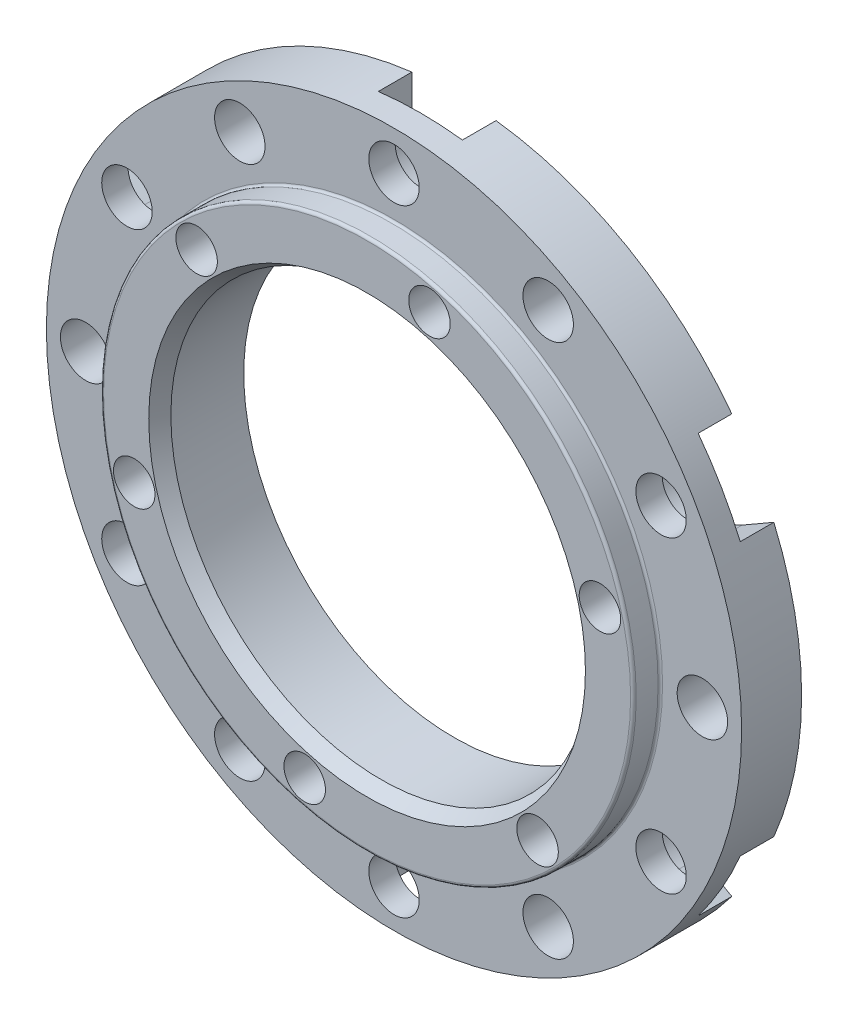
ISO-10303-21;
HEADER;
FILE_DESCRIPTION(('STEP AP214'),'2;1');
FILE_NAME('part.step','',(''),(''),'','','');
FILE_SCHEMA(('AUTOMOTIVE_DESIGN { 1 0 10303 214 1 1 1 1 }'));
ENDSEC;
DATA;
#1=APPLICATION_CONTEXT('core data for automotive mechanical design processes');
#2=APPLICATION_PROTOCOL_DEFINITION('international standard','automotive_design',2000,#1);
#3=PRODUCT_CONTEXT('',#1,'mechanical');
#4=PRODUCT('Part','Part','',(#3));
#5=PRODUCT_RELATED_PRODUCT_CATEGORY('part','',(#4));
#6=PRODUCT_DEFINITION_FORMATION('','',#4);
#7=PRODUCT_DEFINITION_CONTEXT('part definition',#1,'design');
#8=PRODUCT_DEFINITION('design','',#6,#7);
#9=PRODUCT_DEFINITION_SHAPE('','',#8);
#10=(LENGTH_UNIT() NAMED_UNIT(*) SI_UNIT(.MILLI.,.METRE.));
#11=(NAMED_UNIT(*) PLANE_ANGLE_UNIT() SI_UNIT($,.RADIAN.));
#12=(NAMED_UNIT(*) SI_UNIT($,.STERADIAN.) SOLID_ANGLE_UNIT());
#13=UNCERTAINTY_MEASURE_WITH_UNIT(LENGTH_MEASURE(1.E-05),#10,'distance_accuracy_value','');
#14=(GEOMETRIC_REPRESENTATION_CONTEXT(3) GLOBAL_UNCERTAINTY_ASSIGNED_CONTEXT((#13)) GLOBAL_UNIT_ASSIGNED_CONTEXT((#10,
#11,#12)) REPRESENTATION_CONTEXT('',''));
#15=CARTESIAN_POINT('',(0.,0.,0.));
#16=DIRECTION('',(0.,0.,1.));
#17=DIRECTION('',(1.,0.,0.));
#18=AXIS2_PLACEMENT_3D('',#15,#16,#17);
#19=CARTESIAN_POINT('',(0.,0.,17.5846018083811));
#20=DIRECTION('',(0.,0.,1.));
#21=DIRECTION('',(1.,0.,0.));
#22=AXIS2_PLACEMENT_3D('',#19,#20,#21);
#23=CYLINDRICAL_SURFACE('',#22,47.5);
#24=CARTESIAN_POINT('',(0.,0.,-0.83256456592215));
#25=DIRECTION('',(0.,0.,-1.));
#26=DIRECTION('',(-1.,0.,0.));
#27=AXIS2_PLACEMENT_3D('',#24,#25,#26);
#28=CIRCLE('',#27,47.5);
#29=CARTESIAN_POINT('',(-47.5,0.,-0.83256456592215));
#30=VERTEX_POINT('',#29);
#31=EDGE_CURVE('E458',#30,#30,#28,.T.);
#32=ORIENTED_EDGE('',*,*,#31,.T.);
#33=EDGE_LOOP('',(#32));
#34=FACE_BOUND('',#33,.T.);
#35=CARTESIAN_POINT('',(0.,0.,-4.73256456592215));
#36=DIRECTION('',(0.,0.,-1.));
#37=DIRECTION('',(-1.,0.,0.));
#38=AXIS2_PLACEMENT_3D('',#35,#36,#37);
#39=CIRCLE('',#38,47.5);
#40=CARTESIAN_POINT('',(-47.5,0.,-4.73256456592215));
#41=VERTEX_POINT('',#40);
#42=EDGE_CURVE('E449',#41,#41,#39,.F.);
#43=ORIENTED_EDGE('',*,*,#42,.T.);
#44=EDGE_LOOP('',(#43));
#45=FACE_BOUND('',#44,.T.);
#46=ADVANCED_FACE('F30',(#34,#45),#23,.T.);
#47=CARTESIAN_POINT('',(0.,37.5,-0.33256456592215));
#48=DIRECTION('',(0.,0.,-1.));
#49=DIRECTION('',(-1.,0.,0.));
#50=AXIS2_PLACEMENT_3D('',#47,#48,#49);
#51=PLANE('',#50);
#52=CARTESIAN_POINT('',(0.,0.,-0.33256456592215));
#53=DIRECTION('',(0.,0.,-1.));
#54=DIRECTION('',(-1.,0.,0.));
#55=AXIS2_PLACEMENT_3D('',#52,#53,#54);
#56=CIRCLE('',#55,38.9433756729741);
#57=CARTESIAN_POINT('',(-38.9433756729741,0.,-0.33256456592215));
#58=VERTEX_POINT('',#57);
#59=EDGE_CURVE('E11',#58,#58,#56,.T.);
#60=ORIENTED_EDGE('',*,*,#59,.T.);
#61=EDGE_LOOP('',(#60));
#62=FACE_BOUND('',#61,.T.);
#63=CARTESIAN_POINT('',(-30.4055915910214,30.4055915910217,-0.33256456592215));
#64=DIRECTION('',(0.,0.,1.));
#65=DIRECTION('',(1.,0.,0.));
#66=AXIS2_PLACEMENT_3D('',#63,#64,#65);
#67=CIRCLE('',#66,3.70270539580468);
#68=CARTESIAN_POINT('',(-26.7028861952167,30.4055915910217,-0.33256456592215));
#69=VERTEX_POINT('',#68);
#70=EDGE_CURVE('E1075',#69,#69,#67,.T.);
#71=ORIENTED_EDGE('',*,*,#70,.F.);
#72=EDGE_LOOP('',(#71));
#73=FACE_BOUND('',#72,.T.);
#74=CARTESIAN_POINT('',(-41.53481053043,-11.1292189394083,-0.33256456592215));
#75=DIRECTION('',(0.,0.,1.));
#76=DIRECTION('',(1.,0.,0.));
#77=AXIS2_PLACEMENT_3D('',#74,#75,#76);
#78=CIRCLE('',#77,3.70270539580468);
#79=CARTESIAN_POINT('',(-37.8321051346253,-11.1292189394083,-0.33256456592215));
#80=VERTEX_POINT('',#79);
#81=EDGE_CURVE('E1078',#80,#80,#78,.T.);
#82=ORIENTED_EDGE('',*,*,#81,.F.);
#83=EDGE_LOOP('',(#82));
#84=FACE_BOUND('',#83,.T.);
#85=CARTESIAN_POINT('',(-11.1292189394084,-41.5348105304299,-0.33256456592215));
#86=DIRECTION('',(0.,0.,1.));
#87=DIRECTION('',(1.,0.,0.));
#88=AXIS2_PLACEMENT_3D('',#85,#86,#87);
#89=CIRCLE('',#88,3.70270539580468);
#90=CARTESIAN_POINT('',(-7.42651354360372,-41.5348105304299,-0.33256456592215));
#91=VERTEX_POINT('',#90);
#92=EDGE_CURVE('E1084',#91,#91,#89,.T.);
#93=ORIENTED_EDGE('',*,*,#92,.F.);
#94=EDGE_LOOP('',(#93));
#95=FACE_BOUND('',#94,.T.);
#96=CARTESIAN_POINT('',(30.4055915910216,-30.4055915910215,-0.33256456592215));
#97=DIRECTION('',(0.,0.,1.));
#98=DIRECTION('',(1.,0.,0.));
#99=AXIS2_PLACEMENT_3D('',#96,#97,#98);
#100=CIRCLE('',#99,3.70270539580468);
#101=CARTESIAN_POINT('',(34.1082969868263,-30.4055915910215,-0.33256456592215));
#102=VERTEX_POINT('',#101);
#103=EDGE_CURVE('E1090',#102,#102,#100,.T.);
#104=ORIENTED_EDGE('',*,*,#103,.F.);
#105=EDGE_LOOP('',(#104));
#106=FACE_BOUND('',#105,.T.);
#107=CARTESIAN_POINT('',(41.5348105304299,11.1292189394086,-0.33256456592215));
#108=DIRECTION('',(0.,0.,1.));
#109=DIRECTION('',(1.,0.,0.));
#110=AXIS2_PLACEMENT_3D('',#107,#108,#109);
#111=CIRCLE('',#110,3.70270539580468);
#112=CARTESIAN_POINT('',(45.2375159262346,11.1292189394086,-0.33256456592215));
#113=VERTEX_POINT('',#112);
#114=EDGE_CURVE('E1096',#113,#113,#111,.T.);
#115=ORIENTED_EDGE('',*,*,#114,.F.);
#116=EDGE_LOOP('',(#115));
#117=FACE_BOUND('',#116,.T.);
#118=CARTESIAN_POINT('',(11.1292189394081,41.53481053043,-0.33256456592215));
#119=DIRECTION('',(0.,0.,1.));
#120=DIRECTION('',(1.,0.,0.));
#121=AXIS2_PLACEMENT_3D('',#118,#119,#120);
#122=CIRCLE('',#121,3.70270539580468);
#123=CARTESIAN_POINT('',(14.8319243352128,41.53481053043,-0.33256456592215));
#124=VERTEX_POINT('',#123);
#125=EDGE_CURVE('E1102',#124,#124,#122,.T.);
#126=ORIENTED_EDGE('',*,*,#125,.F.);
#127=EDGE_LOOP('',(#126));
#128=FACE_BOUND('',#127,.T.);
#129=CARTESIAN_POINT('',(0.,0.,-0.33256456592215));
#130=DIRECTION('',(0.,0.,-1.));
#131=DIRECTION('',(-1.,0.,0.));
#132=AXIS2_PLACEMENT_3D('',#129,#130,#131);
#133=CIRCLE('',#132,47.);
#134=CARTESIAN_POINT('',(-47.,0.,-0.33256456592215));
#135=VERTEX_POINT('',#134);
#136=EDGE_CURVE('E455',#135,#135,#133,.F.);
#137=ORIENTED_EDGE('',*,*,#136,.T.);
#138=EDGE_LOOP('',(#137));
#139=FACE_BOUND('',#138,.T.);
#140=ADVANCED_FACE('F477',(#62,#73,#84,#95,#106,#117,#128,#139),#51,.F.);
#141=CARTESIAN_POINT('',(0.,0.,17.5846018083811));
#142=DIRECTION('',(0.,0.,1.));
#143=DIRECTION('',(1.,0.,0.));
#144=AXIS2_PLACEMENT_3D('',#141,#142,#143);
#145=CYLINDRICAL_SURFACE('',#144,37.5);
#146=CARTESIAN_POINT('',(0.,0.,-2.83256456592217));
#147=DIRECTION('',(0.,0.,-1.));
#148=DIRECTION('',(-1.,0.,0.));
#149=AXIS2_PLACEMENT_3D('',#146,#147,#148);
#150=CIRCLE('',#149,37.5);
#151=CARTESIAN_POINT('',(-37.5,0.,-2.83256456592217));
#152=VERTEX_POINT('',#151);
#153=EDGE_CURVE('E38',#152,#152,#150,.F.);
#154=ORIENTED_EDGE('',*,*,#153,.T.);
#155=EDGE_LOOP('',(#154));
#156=FACE_BOUND('',#155,.T.);
#157=CARTESIAN_POINT('',(0.,0.,-15.8325645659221));
#158=DIRECTION('',(0.,0.,1.));
#159=DIRECTION('',(1.,0.,0.));
#160=AXIS2_PLACEMENT_3D('',#157,#158,#159);
#161=CIRCLE('',#160,37.5);
#162=CARTESIAN_POINT('',(37.5,0.,-15.8325645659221));
#163=VERTEX_POINT('',#162);
#164=EDGE_CURVE('E374',#163,#163,#161,.T.);
#165=ORIENTED_EDGE('',*,*,#164,.F.);
#166=EDGE_LOOP('',(#165));
#167=FACE_BOUND('',#166,.T.);
#168=ADVANCED_FACE('F463',(#156,#167),#145,.F.);
#169=CARTESIAN_POINT('',(0.,62.,-15.8325645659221));
#170=DIRECTION('',(0.,0.,1.));
#171=DIRECTION('',(1.,0.,0.));
#172=AXIS2_PLACEMENT_3D('',#169,#170,#171);
#173=PLANE('',#172);
#174=CARTESIAN_POINT('',(27.4999999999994,47.6313972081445,-15.8325645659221));
#175=DIRECTION('',(0.,0.,-1.));
#176=DIRECTION('',(-1.,0.,0.));
#177=AXIS2_PLACEMENT_3D('',#174,#175,#176);
#178=CIRCLE('',#177,4.5);
#179=CARTESIAN_POINT('',(22.9999999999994,47.6313972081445,-15.8325645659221));
#180=VERTEX_POINT('',#179);
#181=EDGE_CURVE('E337',#180,#180,#178,.T.);
#182=ORIENTED_EDGE('',*,*,#181,.F.);
#183=EDGE_LOOP('',(#182));
#184=FACE_BOUND('',#183,.T.);
#185=CARTESIAN_POINT('',(55.,5.76094754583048E-13,-15.8325645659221));
#186=DIRECTION('',(0.,0.,-1.));
#187=DIRECTION('',(-1.,0.,0.));
#188=AXIS2_PLACEMENT_3D('',#185,#186,#187);
#189=CIRCLE('',#188,4.5);
#190=CARTESIAN_POINT('',(50.5,5.76094754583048E-13,-15.8325645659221));
#191=VERTEX_POINT('',#190);
#192=EDGE_CURVE('E341',#191,#191,#189,.T.);
#193=ORIENTED_EDGE('',*,*,#192,.F.);
#194=EDGE_LOOP('',(#193));
#195=FACE_BOUND('',#194,.T.);
#196=CARTESIAN_POINT('',(27.5000000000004,-47.6313972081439,-15.8325645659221));
#197=DIRECTION('',(0.,0.,-1.));
#198=DIRECTION('',(-1.,0.,0.));
#199=AXIS2_PLACEMENT_3D('',#196,#197,#198);
#200=CIRCLE('',#199,4.5);
#201=CARTESIAN_POINT('',(23.0000000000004,-47.6313972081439,-15.8325645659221));
#202=VERTEX_POINT('',#201);
#203=EDGE_CURVE('E346',#202,#202,#200,.T.);
#204=ORIENTED_EDGE('',*,*,#203,.F.);
#205=EDGE_LOOP('',(#204));
#206=FACE_BOUND('',#205,.T.);
#207=CARTESIAN_POINT('',(-27.4999999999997,-47.6313972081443,-15.8325645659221));
#208=DIRECTION('',(0.,0.,-1.));
#209=DIRECTION('',(-1.,0.,0.));
#210=AXIS2_PLACEMENT_3D('',#207,#208,#209);
#211=CIRCLE('',#210,4.5);
#212=CARTESIAN_POINT('',(-31.9999999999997,-47.6313972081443,-15.8325645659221));
#213=VERTEX_POINT('',#212);
#214=EDGE_CURVE('E351',#213,#213,#211,.T.);
#215=ORIENTED_EDGE('',*,*,#214,.F.);
#216=EDGE_LOOP('',(#215));
#217=FACE_BOUND('',#216,.T.);
#218=CARTESIAN_POINT('',(-55.,-1.92031584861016E-13,-15.8325645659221));
#219=DIRECTION('',(0.,0.,-1.));
#220=DIRECTION('',(-1.,0.,0.));
#221=AXIS2_PLACEMENT_3D('',#218,#219,#220);
#222=CIRCLE('',#221,4.5);
#223=CARTESIAN_POINT('',(-59.5,-1.92031584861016E-13,-15.8325645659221));
#224=VERTEX_POINT('',#223);
#225=EDGE_CURVE('E356',#224,#224,#222,.T.);
#226=ORIENTED_EDGE('',*,*,#225,.F.);
#227=EDGE_LOOP('',(#226));
#228=FACE_BOUND('',#227,.T.);
#229=CARTESIAN_POINT('',(-27.5000000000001,47.6313972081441,-15.8325645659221));
#230=DIRECTION('',(0.,0.,-1.));
#231=DIRECTION('',(-1.,0.,0.));
#232=AXIS2_PLACEMENT_3D('',#229,#230,#231);
#233=CIRCLE('',#232,4.5);
#234=CARTESIAN_POINT('',(-32.,47.6313972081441,-15.8325645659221));
#235=VERTEX_POINT('',#234);
#236=EDGE_CURVE('E361',#235,#235,#233,.T.);
#237=ORIENTED_EDGE('',*,*,#236,.F.);
#238=EDGE_LOOP('',(#237));
#239=FACE_BOUND('',#238,.T.);
#240=CARTESIAN_POINT('',(47.6313972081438,27.5000000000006,-15.8325645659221));
#241=DIRECTION('',(0.,0.,-1.));
#242=DIRECTION('',(1.,0.,0.));
#243=AXIS2_PLACEMENT_3D('',#240,#241,#242);
#244=CIRCLE('',#243,7.5);
#245=CARTESIAN_POINT('',(51.3813972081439,21.0048094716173,-15.8325645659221));
#246=VERTEX_POINT('',#245);
#247=CARTESIAN_POINT('',(43.8813972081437,33.9951905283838,-15.8325645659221));
#248=VERTEX_POINT('',#247);
#249=EDGE_CURVE('E219',#246,#248,#244,.T.);
#250=ORIENTED_EDGE('',*,*,#249,.F.);
#251=DIRECTION('',(-0.866025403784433,-0.50000000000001,0.));
#252=VECTOR('',#251,1.);
#253=CARTESIAN_POINT('',(51.3813972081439,21.0048094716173,-15.8325645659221));
#254=LINE('',#253,#252);
#255=CARTESIAN_POINT('',(57.0492729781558,24.2771590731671,-15.8325645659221));
#256=VERTEX_POINT('',#255);
#257=EDGE_CURVE('E205',#256,#246,#254,.T.);
#258=ORIENTED_EDGE('',*,*,#257,.F.);
#259=CARTESIAN_POINT('',(0.,0.,-15.8325645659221));
#260=DIRECTION('',(0.,0.,1.));
#261=DIRECTION('',(1.,0.,0.));
#262=AXIS2_PLACEMENT_3D('',#259,#260,#261);
#263=CIRCLE('',#262,62.);
#264=CARTESIAN_POINT('',(57.0492729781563,-24.2771590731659,-15.8325645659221));
#265=VERTEX_POINT('',#264);
#266=EDGE_CURVE('E1147',#265,#256,#263,.T.);
#267=ORIENTED_EDGE('',*,*,#266,.F.);
#268=DIRECTION('',(0.866025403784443,-0.499999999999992,0.));
#269=VECTOR('',#268,1.);
#270=CARTESIAN_POINT('',(62.7625218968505,-27.5757048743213,-15.8325645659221));
#271=LINE('',#270,#269);
#272=CARTESIAN_POINT('',(51.3813972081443,-21.0048094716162,-15.8325645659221));
#273=VERTEX_POINT('',#272);
#274=EDGE_CURVE('E224',#273,#265,#271,.T.);
#275=ORIENTED_EDGE('',*,*,#274,.F.);
#276=CARTESIAN_POINT('',(47.6313972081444,-27.4999999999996,-15.8325645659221));
#277=DIRECTION('',(0.,0.,-1.));
#278=DIRECTION('',(1.,0.,0.));
#279=AXIS2_PLACEMENT_3D('',#276,#277,#278);
#280=CIRCLE('',#279,7.5);
#281=CARTESIAN_POINT('',(43.8813972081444,-33.9951905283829,-15.8325645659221));
#282=VERTEX_POINT('',#281);
#283=EDGE_CURVE('E227',#282,#273,#280,.T.);
#284=ORIENTED_EDGE('',*,*,#283,.F.);
#285=DIRECTION('',(-0.866025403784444,0.499999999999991,0.));
#286=VECTOR('',#285,1.);
#287=CARTESIAN_POINT('',(43.8813972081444,-33.9951905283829,-15.8325645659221));
#288=LINE('',#287,#286);
#289=CARTESIAN_POINT('',(49.5492729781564,-37.2675401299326,-15.8325645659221));
#290=VERTEX_POINT('',#289);
#291=EDGE_CURVE('E233',#290,#282,#288,.T.);
#292=ORIENTED_EDGE('',*,*,#291,.F.);
#293=CARTESIAN_POINT('',(7.50000000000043,-61.5446992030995,-15.8325645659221));
#294=VERTEX_POINT('',#293);
#295=EDGE_CURVE('E1149',#294,#290,#263,.T.);
#296=ORIENTED_EDGE('',*,*,#295,.F.);
#297=DIRECTION('',(0.,-1.,0.));
#298=VECTOR('',#297,1.);
#299=CARTESIAN_POINT('',(7.50000000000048,-68.1417908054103,-15.8325645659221));
#300=LINE('',#299,#298);
#301=CARTESIAN_POINT('',(7.50000000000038,-54.9999999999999,-15.8325645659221));
#302=VERTEX_POINT('',#301);
#303=EDGE_CURVE('E245',#302,#294,#300,.T.);
#304=ORIENTED_EDGE('',*,*,#303,.F.);
#305=CARTESIAN_POINT('',(3.84063169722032E-13,-55.,-15.8325645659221));
#306=DIRECTION('',(0.,0.,-1.));
#307=DIRECTION('',(1.,0.,0.));
#308=AXIS2_PLACEMENT_3D('',#305,#306,#307);
#309=CIRCLE('',#308,7.5);
#310=CARTESIAN_POINT('',(-7.49999999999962,-55.0000000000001,-15.8325645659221));
#311=VERTEX_POINT('',#310);
#312=EDGE_CURVE('E249',#311,#302,#309,.T.);
#313=ORIENTED_EDGE('',*,*,#312,.F.);
#314=DIRECTION('',(0.,1.,0.));
#315=VECTOR('',#314,1.);
#316=CARTESIAN_POINT('',(-7.49999999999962,-55.0000000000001,-15.8325645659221));
#317=LINE('',#316,#315);
#318=CARTESIAN_POINT('',(-7.49999999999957,-61.5446992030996,-15.8325645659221));
#319=VERTEX_POINT('',#318);
#320=EDGE_CURVE('E256',#319,#311,#317,.T.);
#321=ORIENTED_EDGE('',*,*,#320,.F.);
#322=CARTESIAN_POINT('',(-49.5492729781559,-37.2675401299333,-15.8325645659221));
#323=VERTEX_POINT('',#322);
#324=EDGE_CURVE('E1151',#323,#319,#263,.T.);
#325=ORIENTED_EDGE('',*,*,#324,.F.);
#326=DIRECTION('',(-0.866025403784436,-0.500000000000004,0.));
#327=VECTOR('',#326,1.);
#328=CARTESIAN_POINT('',(-55.26252189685,-40.5660859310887,-15.8325645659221));
#329=LINE('',#328,#327);
#330=CARTESIAN_POINT('',(-43.881397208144,-33.9951905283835,-15.8325645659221));
#331=VERTEX_POINT('',#330);
#332=EDGE_CURVE('E268',#331,#323,#329,.T.);
#333=ORIENTED_EDGE('',*,*,#332,.F.);
#334=CARTESIAN_POINT('',(-47.631397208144,-27.5000000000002,-15.8325645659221));
#335=DIRECTION('',(0.,0.,-1.));
#336=DIRECTION('',(1.,0.,0.));
#337=AXIS2_PLACEMENT_3D('',#334,#335,#336);
#338=CIRCLE('',#337,7.5);
#339=CARTESIAN_POINT('',(-51.381397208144,-21.0048094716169,-15.8325645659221));
#340=VERTEX_POINT('',#339);
#341=EDGE_CURVE('E272',#340,#331,#338,.T.);
#342=ORIENTED_EDGE('',*,*,#341,.F.);
#343=DIRECTION('',(0.866025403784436,0.500000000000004,0.));
#344=VECTOR('',#343,1.);
#345=CARTESIAN_POINT('',(-51.381397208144,-21.0048094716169,-15.8325645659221));
#346=LINE('',#345,#344);
#347=CARTESIAN_POINT('',(-57.049272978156,-24.2771590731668,-15.8325645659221));
#348=VERTEX_POINT('',#347);
#349=EDGE_CURVE('E279',#348,#340,#346,.T.);
#350=ORIENTED_EDGE('',*,*,#349,.F.);
#351=CARTESIAN_POINT('',(-57.0492729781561,24.2771590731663,-15.8325645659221));
#352=VERTEX_POINT('',#351);
#353=EDGE_CURVE('E375',#352,#348,#263,.T.);
#354=ORIENTED_EDGE('',*,*,#353,.F.);
#355=DIRECTION('',(-0.86602540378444,0.499999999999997,0.));
#356=VECTOR('',#355,1.);
#357=CARTESIAN_POINT('',(-62.7625218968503,27.5757048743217,-15.8325645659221));
#358=LINE('',#357,#356);
#359=CARTESIAN_POINT('',(-51.3813972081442,21.0048094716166,-15.8325645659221));
#360=VERTEX_POINT('',#359);
#361=EDGE_CURVE('E291',#360,#352,#358,.T.);
#362=ORIENTED_EDGE('',*,*,#361,.F.);
#363=CARTESIAN_POINT('',(-47.6313972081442,27.4999999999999,-15.8325645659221));
#364=DIRECTION('',(0.,0.,-1.));
#365=DIRECTION('',(1.,0.,0.));
#366=AXIS2_PLACEMENT_3D('',#363,#364,#365);
#367=CIRCLE('',#366,7.5);
#368=CARTESIAN_POINT('',(-43.8813972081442,33.9951905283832,-15.8325645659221));
#369=VERTEX_POINT('',#368);
#370=EDGE_CURVE('E295',#369,#360,#367,.T.);
#371=ORIENTED_EDGE('',*,*,#370,.F.);
#372=DIRECTION('',(0.86602540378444,-0.499999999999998,0.));
#373=VECTOR('',#372,1.);
#374=CARTESIAN_POINT('',(-43.8813972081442,33.9951905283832,-15.8325645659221));
#375=LINE('',#374,#373);
#376=CARTESIAN_POINT('',(-49.5492729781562,37.2675401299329,-15.8325645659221));
#377=VERTEX_POINT('',#376);
#378=EDGE_CURVE('E302',#377,#369,#375,.T.);
#379=ORIENTED_EDGE('',*,*,#378,.F.);
#380=CARTESIAN_POINT('',(-7.5,61.5446992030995,-15.8325645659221));
#381=VERTEX_POINT('',#380);
#382=EDGE_CURVE('E371',#381,#377,#263,.T.);
#383=ORIENTED_EDGE('',*,*,#382,.F.);
#384=DIRECTION('',(0.,1.,0.));
#385=VECTOR('',#384,1.);
#386=CARTESIAN_POINT('',(-7.5,61.5446992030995,-15.8325645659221));
#387=LINE('',#386,#385);
#388=CARTESIAN_POINT('',(-7.5,55.,-15.8325645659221));
#389=VERTEX_POINT('',#388);
#390=EDGE_CURVE('E318',#389,#381,#387,.T.);
#391=ORIENTED_EDGE('',*,*,#390,.F.);
#392=CARTESIAN_POINT('',(0.,55.,-15.8325645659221));
#393=DIRECTION('',(0.,0.,-1.));
#394=DIRECTION('',(1.,0.,0.));
#395=AXIS2_PLACEMENT_3D('',#392,#393,#394);
#396=CIRCLE('',#395,7.5);
#397=CARTESIAN_POINT('',(7.5,55.,-15.8325645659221));
#398=VERTEX_POINT('',#397);
#399=EDGE_CURVE('E325',#398,#389,#396,.T.);
#400=ORIENTED_EDGE('',*,*,#399,.F.);
#401=DIRECTION('',(0.,-1.,0.));
#402=VECTOR('',#401,1.);
#403=CARTESIAN_POINT('',(7.5,55.,-15.8325645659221));
#404=LINE('',#403,#402);
#405=CARTESIAN_POINT('',(7.5,61.5446992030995,-15.8325645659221));
#406=VERTEX_POINT('',#405);
#407=EDGE_CURVE('E314',#406,#398,#404,.T.);
#408=ORIENTED_EDGE('',*,*,#407,.F.);
#409=CARTESIAN_POINT('',(49.5492729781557,37.2675401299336,-15.8325645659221));
#410=VERTEX_POINT('',#409);
#411=EDGE_CURVE('E369',#410,#406,#263,.T.);
#412=ORIENTED_EDGE('',*,*,#411,.F.);
#413=DIRECTION('',(0.866025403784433,0.50000000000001,0.));
#414=VECTOR('',#413,1.);
#415=CARTESIAN_POINT('',(55.2625218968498,40.5660859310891,-15.8325645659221));
#416=LINE('',#415,#414);
#417=EDGE_CURVE('E215',#248,#410,#416,.T.);
#418=ORIENTED_EDGE('',*,*,#417,.F.);
#419=EDGE_LOOP('',(#250,#258,#267,#275,#284,#292,#296,#304,#313,#321,#325,#333,#342,#350,#354,
#362,#371,#379,#383,#391,#400,#408,#412,#418));
#420=FACE_BOUND('',#419,.T.);
#421=ORIENTED_EDGE('',*,*,#164,.T.);
#422=EDGE_LOOP('',(#421));
#423=FACE_BOUND('',#422,.T.);
#424=ADVANCED_FACE('F661',(#184,#195,#206,#217,#228,#239,#420,#423),#173,.F.);
#425=CARTESIAN_POINT('',(0.,0.,17.5846018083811));
#426=DIRECTION('',(0.,0.,1.));
#427=DIRECTION('',(1.,0.,0.));
#428=AXIS2_PLACEMENT_3D('',#425,#426,#427);
#429=CYLINDRICAL_SURFACE('',#428,62.);
#430=ORIENTED_EDGE('',*,*,#266,.T.);
#431=DIRECTION('',(0.,0.,1.));
#432=VECTOR('',#431,1.);
#433=CARTESIAN_POINT('',(57.0492729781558,24.2771590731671,17.5846018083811));
#434=LINE('',#433,#432);
#435=CARTESIAN_POINT('',(57.0492729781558,24.2771590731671,-9.83256456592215));
#436=VERTEX_POINT('',#435);
#437=EDGE_CURVE('E447',#256,#436,#434,.T.);
#438=ORIENTED_EDGE('',*,*,#437,.T.);
#439=CARTESIAN_POINT('',(0.,0.,-9.83256456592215));
#440=DIRECTION('',(0.,0.,1.));
#441=DIRECTION('',(1.,0.,0.));
#442=AXIS2_PLACEMENT_3D('',#439,#440,#441);
#443=CIRCLE('',#442,62.);
#444=CARTESIAN_POINT('',(49.5492729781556,37.2675401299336,-9.83256456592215));
#445=VERTEX_POINT('',#444);
#446=EDGE_CURVE('E197',#436,#445,#443,.T.);
#447=ORIENTED_EDGE('',*,*,#446,.T.);
#448=DIRECTION('',(0.,0.,1.));
#449=VECTOR('',#448,1.);
#450=CARTESIAN_POINT('',(49.5492729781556,37.2675401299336,17.5846018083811));
#451=LINE('',#450,#449);
#452=EDGE_CURVE('E442',#445,#410,#451,.F.);
#453=ORIENTED_EDGE('',*,*,#452,.T.);
#454=ORIENTED_EDGE('',*,*,#411,.T.);
#455=DIRECTION('',(0.,0.,1.));
#456=VECTOR('',#455,1.);
#457=CARTESIAN_POINT('',(7.5,61.5446992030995,17.5846018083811));
#458=LINE('',#457,#456);
#459=CARTESIAN_POINT('',(7.5,61.5446992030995,-9.83256456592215));
#460=VERTEX_POINT('',#459);
#461=EDGE_CURVE('E378',#406,#460,#458,.T.);
#462=ORIENTED_EDGE('',*,*,#461,.T.);
#463=CARTESIAN_POINT('',(0.,0.,-9.83256456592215));
#464=DIRECTION('',(0.,0.,1.));
#465=DIRECTION('',(1.,0.,0.));
#466=AXIS2_PLACEMENT_3D('',#463,#464,#465);
#467=CIRCLE('',#466,62.);
#468=CARTESIAN_POINT('',(-7.5,61.5446992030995,-9.83256456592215));
#469=VERTEX_POINT('',#468);
#470=EDGE_CURVE('E334',#460,#469,#467,.T.);
#471=ORIENTED_EDGE('',*,*,#470,.T.);
#472=DIRECTION('',(0.,0.,1.));
#473=VECTOR('',#472,1.);
#474=CARTESIAN_POINT('',(-7.5,61.5446992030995,17.5846018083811));
#475=LINE('',#474,#473);
#476=EDGE_CURVE('E407',#469,#381,#475,.F.);
#477=ORIENTED_EDGE('',*,*,#476,.T.);
#478=ORIENTED_EDGE('',*,*,#382,.T.);
#479=DIRECTION('',(0.,0.,1.));
#480=VECTOR('',#479,1.);
#481=CARTESIAN_POINT('',(-49.5492729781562,37.2675401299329,17.5846018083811));
#482=LINE('',#481,#480);
#483=CARTESIAN_POINT('',(-49.5492729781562,37.2675401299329,-9.83256456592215));
#484=VERTEX_POINT('',#483);
#485=EDGE_CURVE('E415',#377,#484,#482,.T.);
#486=ORIENTED_EDGE('',*,*,#485,.T.);
#487=CARTESIAN_POINT('',(0.,0.,-9.83256456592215));
#488=DIRECTION('',(0.,0.,1.));
#489=DIRECTION('',(1.,0.,0.));
#490=AXIS2_PLACEMENT_3D('',#487,#488,#489);
#491=CIRCLE('',#490,62.);
#492=CARTESIAN_POINT('',(-57.0492729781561,24.2771590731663,-9.83256456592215));
#493=VERTEX_POINT('',#492);
#494=EDGE_CURVE('E311',#484,#493,#491,.T.);
#495=ORIENTED_EDGE('',*,*,#494,.T.);
#496=DIRECTION('',(0.,0.,1.));
#497=VECTOR('',#496,1.);
#498=CARTESIAN_POINT('',(-57.0492729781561,24.2771590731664,17.5846018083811));
#499=LINE('',#498,#497);
#500=EDGE_CURVE('E410',#493,#352,#499,.F.);
#501=ORIENTED_EDGE('',*,*,#500,.T.);
#502=ORIENTED_EDGE('',*,*,#353,.T.);
#503=DIRECTION('',(0.,0.,1.));
#504=VECTOR('',#503,1.);
#505=CARTESIAN_POINT('',(-57.049272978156,-24.2771590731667,17.5846018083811));
#506=LINE('',#505,#504);
#507=CARTESIAN_POINT('',(-57.049272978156,-24.2771590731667,-9.83256456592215));
#508=VERTEX_POINT('',#507);
#509=EDGE_CURVE('E423',#348,#508,#506,.T.);
#510=ORIENTED_EDGE('',*,*,#509,.T.);
#511=CARTESIAN_POINT('',(0.,0.,-9.83256456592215));
#512=DIRECTION('',(0.,0.,1.));
#513=DIRECTION('',(1.,0.,0.));
#514=AXIS2_PLACEMENT_3D('',#511,#512,#513);
#515=CIRCLE('',#514,62.);
#516=CARTESIAN_POINT('',(-49.5492729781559,-37.2675401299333,-9.83256456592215));
#517=VERTEX_POINT('',#516);
#518=EDGE_CURVE('E288',#508,#517,#515,.T.);
#519=ORIENTED_EDGE('',*,*,#518,.T.);
#520=DIRECTION('',(0.,0.,1.));
#521=VECTOR('',#520,1.);
#522=CARTESIAN_POINT('',(-49.5492729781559,-37.2675401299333,17.5846018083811));
#523=LINE('',#522,#521);
#524=EDGE_CURVE('E418',#517,#323,#523,.F.);
#525=ORIENTED_EDGE('',*,*,#524,.T.);
#526=ORIENTED_EDGE('',*,*,#324,.T.);
#527=DIRECTION('',(0.,0.,1.));
#528=VECTOR('',#527,1.);
#529=CARTESIAN_POINT('',(-7.49999999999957,-61.5446992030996,17.5846018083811));
#530=LINE('',#529,#528);
#531=CARTESIAN_POINT('',(-7.49999999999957,-61.5446992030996,-9.83256456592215));
#532=VERTEX_POINT('',#531);
#533=EDGE_CURVE('E431',#319,#532,#530,.T.);
#534=ORIENTED_EDGE('',*,*,#533,.T.);
#535=CARTESIAN_POINT('',(0.,0.,-9.83256456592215));
#536=DIRECTION('',(0.,0.,1.));
#537=DIRECTION('',(1.,0.,0.));
#538=AXIS2_PLACEMENT_3D('',#535,#536,#537);
#539=CIRCLE('',#538,62.);
#540=CARTESIAN_POINT('',(7.50000000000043,-61.5446992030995,-9.83256456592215));
#541=VERTEX_POINT('',#540);
#542=EDGE_CURVE('E265',#532,#541,#539,.T.);
#543=ORIENTED_EDGE('',*,*,#542,.T.);
#544=DIRECTION('',(0.,0.,1.));
#545=VECTOR('',#544,1.);
#546=CARTESIAN_POINT('',(7.50000000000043,-61.5446992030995,17.5846018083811));
#547=LINE('',#546,#545);
#548=EDGE_CURVE('E426',#541,#294,#547,.F.);
#549=ORIENTED_EDGE('',*,*,#548,.T.);
#550=ORIENTED_EDGE('',*,*,#295,.T.);
#551=DIRECTION('',(0.,0.,1.));
#552=VECTOR('',#551,1.);
#553=CARTESIAN_POINT('',(49.5492729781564,-37.2675401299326,17.5846018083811));
#554=LINE('',#553,#552);
#555=CARTESIAN_POINT('',(49.5492729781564,-37.2675401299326,-9.83256456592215));
#556=VERTEX_POINT('',#555);
#557=EDGE_CURVE('E439',#290,#556,#554,.T.);
#558=ORIENTED_EDGE('',*,*,#557,.T.);
#559=CARTESIAN_POINT('',(0.,0.,-9.83256456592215));
#560=DIRECTION('',(0.,0.,1.));
#561=DIRECTION('',(1.,0.,0.));
#562=AXIS2_PLACEMENT_3D('',#559,#560,#561);
#563=CIRCLE('',#562,62.);
#564=CARTESIAN_POINT('',(57.0492729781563,-24.2771590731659,-9.83256456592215));
#565=VERTEX_POINT('',#564);
#566=EDGE_CURVE('E242',#556,#565,#563,.T.);
#567=ORIENTED_EDGE('',*,*,#566,.T.);
#568=DIRECTION('',(0.,0.,1.));
#569=VECTOR('',#568,1.);
#570=CARTESIAN_POINT('',(57.0492729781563,-24.2771590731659,17.5846018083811));
#571=LINE('',#570,#569);
#572=EDGE_CURVE('E434',#565,#265,#571,.F.);
#573=ORIENTED_EDGE('',*,*,#572,.T.);
#574=EDGE_LOOP('',(#430,#438,#447,#453,#454,#462,#471,#477,#478,#486,#495,#501,#502,#510,#519,
#525,#526,#534,#543,#549,#550,#558,#567,#573));
#575=FACE_BOUND('',#574,.T.);
#576=CARTESIAN_POINT('',(0.,0.,-5.13256456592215));
#577=DIRECTION('',(0.,0.,1.));
#578=DIRECTION('',(1.,0.,0.));
#579=AXIS2_PLACEMENT_3D('',#576,#577,#578);
#580=CIRCLE('',#579,62.);
#581=CARTESIAN_POINT('',(62.,0.,-5.13256456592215));
#582=VERTEX_POINT('',#581);
#583=EDGE_CURVE('E366',#582,#582,#580,.T.);
#584=ORIENTED_EDGE('',*,*,#583,.F.);
#585=EDGE_LOOP('',(#584));
#586=FACE_BOUND('',#585,.T.);
#587=ADVANCED_FACE('F657',(#575,#586),#429,.T.);
#588=CARTESIAN_POINT('',(0.,47.5,-5.13256456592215));
#589=DIRECTION('',(0.,0.,-1.));
#590=DIRECTION('',(-1.,0.,0.));
#591=AXIS2_PLACEMENT_3D('',#588,#589,#590);
#592=PLANE('',#591);
#593=CARTESIAN_POINT('',(0.,0.,-5.13256456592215));
#594=DIRECTION('',(0.,0.,-1.));
#595=DIRECTION('',(-1.,0.,0.));
#596=AXIS2_PLACEMENT_3D('',#593,#594,#595);
#597=CIRCLE('',#596,47.9);
#598=CARTESIAN_POINT('',(-47.9,0.,-5.13256456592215));
#599=VERTEX_POINT('',#598);
#600=EDGE_CURVE('E452',#599,#599,#597,.T.);
#601=ORIENTED_EDGE('',*,*,#600,.T.);
#602=EDGE_LOOP('',(#601));
#603=FACE_BOUND('',#602,.T.);
#604=CARTESIAN_POINT('',(27.4999999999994,47.6313972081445,-5.13256456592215));
#605=DIRECTION('',(0.,0.,-1.));
#606=DIRECTION('',(-1.,0.,0.));
#607=AXIS2_PLACEMENT_3D('',#604,#605,#606);
#608=CIRCLE('',#607,4.5);
#609=CARTESIAN_POINT('',(22.9999999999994,47.6313972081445,-5.13256456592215));
#610=VERTEX_POINT('',#609);
#611=EDGE_CURVE('E340',#610,#610,#608,.T.);
#612=ORIENTED_EDGE('',*,*,#611,.T.);
#613=EDGE_LOOP('',(#612));
#614=FACE_BOUND('',#613,.T.);
#615=CARTESIAN_POINT('',(47.6313972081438,27.5000000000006,-5.13256456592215));
#616=DIRECTION('',(0.,0.,-1.));
#617=DIRECTION('',(-1.,0.,0.));
#618=AXIS2_PLACEMENT_3D('',#615,#616,#617);
#619=CIRCLE('',#618,4.5);
#620=CARTESIAN_POINT('',(43.1313972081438,27.5000000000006,-5.13256456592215));
#621=VERTEX_POINT('',#620);
#622=EDGE_CURVE('E345',#621,#621,#619,.T.);
#623=ORIENTED_EDGE('',*,*,#622,.T.);
#624=EDGE_LOOP('',(#623));
#625=FACE_BOUND('',#624,.T.);
#626=CARTESIAN_POINT('',(55.,5.76094754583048E-13,-5.13256456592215));
#627=DIRECTION('',(0.,0.,-1.));
#628=DIRECTION('',(-1.,0.,0.));
#629=AXIS2_PLACEMENT_3D('',#626,#627,#628);
#630=CIRCLE('',#629,4.5);
#631=CARTESIAN_POINT('',(50.5,5.76094754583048E-13,-5.13256456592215));
#632=VERTEX_POINT('',#631);
#633=EDGE_CURVE('E344',#632,#632,#630,.T.);
#634=ORIENTED_EDGE('',*,*,#633,.T.);
#635=EDGE_LOOP('',(#634));
#636=FACE_BOUND('',#635,.T.);
#637=CARTESIAN_POINT('',(47.6313972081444,-27.4999999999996,-5.13256456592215));
#638=DIRECTION('',(0.,0.,-1.));
#639=DIRECTION('',(-1.,0.,0.));
#640=AXIS2_PLACEMENT_3D('',#637,#638,#639);
#641=CIRCLE('',#640,4.5);
#642=CARTESIAN_POINT('',(43.1313972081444,-27.4999999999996,-5.13256456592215));
#643=VERTEX_POINT('',#642);
#644=EDGE_CURVE('E350',#643,#643,#641,.T.);
#645=ORIENTED_EDGE('',*,*,#644,.T.);
#646=EDGE_LOOP('',(#645));
#647=FACE_BOUND('',#646,.T.);
#648=CARTESIAN_POINT('',(27.5000000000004,-47.6313972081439,-5.13256456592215));
#649=DIRECTION('',(0.,0.,-1.));
#650=DIRECTION('',(-1.,0.,0.));
#651=AXIS2_PLACEMENT_3D('',#648,#649,#650);
#652=CIRCLE('',#651,4.5);
#653=CARTESIAN_POINT('',(23.0000000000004,-47.6313972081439,-5.13256456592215));
#654=VERTEX_POINT('',#653);
#655=EDGE_CURVE('E349',#654,#654,#652,.T.);
#656=ORIENTED_EDGE('',*,*,#655,.T.);
#657=EDGE_LOOP('',(#656));
#658=FACE_BOUND('',#657,.T.);
#659=CARTESIAN_POINT('',(3.84063169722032E-13,-55.,-5.13256456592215));
#660=DIRECTION('',(0.,0.,-1.));
#661=DIRECTION('',(-1.,0.,0.));
#662=AXIS2_PLACEMENT_3D('',#659,#660,#661);
#663=CIRCLE('',#662,4.5);
#664=CARTESIAN_POINT('',(-4.49999999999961,-55.,-5.13256456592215));
#665=VERTEX_POINT('',#664);
#666=EDGE_CURVE('E355',#665,#665,#663,.T.);
#667=ORIENTED_EDGE('',*,*,#666,.T.);
#668=EDGE_LOOP('',(#667));
#669=FACE_BOUND('',#668,.T.);
#670=CARTESIAN_POINT('',(-27.4999999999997,-47.6313972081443,-5.13256456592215));
#671=DIRECTION('',(0.,0.,-1.));
#672=DIRECTION('',(-1.,0.,0.));
#673=AXIS2_PLACEMENT_3D('',#670,#671,#672);
#674=CIRCLE('',#673,4.5);
#675=CARTESIAN_POINT('',(-31.9999999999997,-47.6313972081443,-5.13256456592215));
#676=VERTEX_POINT('',#675);
#677=EDGE_CURVE('E354',#676,#676,#674,.T.);
#678=ORIENTED_EDGE('',*,*,#677,.T.);
#679=EDGE_LOOP('',(#678));
#680=FACE_BOUND('',#679,.T.);
#681=CARTESIAN_POINT('',(-47.631397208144,-27.5000000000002,-5.13256456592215));
#682=DIRECTION('',(0.,0.,-1.));
#683=DIRECTION('',(-1.,0.,0.));
#684=AXIS2_PLACEMENT_3D('',#681,#682,#683);
#685=CIRCLE('',#684,4.5);
#686=CARTESIAN_POINT('',(-52.131397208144,-27.5000000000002,-5.13256456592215));
#687=VERTEX_POINT('',#686);
#688=EDGE_CURVE('E360',#687,#687,#685,.T.);
#689=ORIENTED_EDGE('',*,*,#688,.T.);
#690=EDGE_LOOP('',(#689));
#691=FACE_BOUND('',#690,.T.);
#692=CARTESIAN_POINT('',(-55.,-1.92031584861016E-13,-5.13256456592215));
#693=DIRECTION('',(0.,0.,-1.));
#694=DIRECTION('',(-1.,0.,0.));
#695=AXIS2_PLACEMENT_3D('',#692,#693,#694);
#696=CIRCLE('',#695,4.5);
#697=CARTESIAN_POINT('',(-59.5,-1.92031584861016E-13,-5.13256456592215));
#698=VERTEX_POINT('',#697);
#699=EDGE_CURVE('E359',#698,#698,#696,.T.);
#700=ORIENTED_EDGE('',*,*,#699,.T.);
#701=EDGE_LOOP('',(#700));
#702=FACE_BOUND('',#701,.T.);
#703=CARTESIAN_POINT('',(-47.6313972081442,27.4999999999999,-5.13256456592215));
#704=DIRECTION('',(0.,0.,-1.));
#705=DIRECTION('',(-1.,0.,0.));
#706=AXIS2_PLACEMENT_3D('',#703,#704,#705);
#707=CIRCLE('',#706,4.49999999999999);
#708=CARTESIAN_POINT('',(-52.1313972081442,27.4999999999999,-5.13256456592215));
#709=VERTEX_POINT('',#708);
#710=EDGE_CURVE('E365',#709,#709,#707,.T.);
#711=ORIENTED_EDGE('',*,*,#710,.T.);
#712=EDGE_LOOP('',(#711));
#713=FACE_BOUND('',#712,.T.);
#714=CARTESIAN_POINT('',(-27.5000000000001,47.6313972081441,-5.13256456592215));
#715=DIRECTION('',(0.,0.,-1.));
#716=DIRECTION('',(-1.,0.,0.));
#717=AXIS2_PLACEMENT_3D('',#714,#715,#716);
#718=CIRCLE('',#717,4.5);
#719=CARTESIAN_POINT('',(-32.,47.6313972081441,-5.13256456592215));
#720=VERTEX_POINT('',#719);
#721=EDGE_CURVE('E364',#720,#720,#718,.T.);
#722=ORIENTED_EDGE('',*,*,#721,.T.);
#723=EDGE_LOOP('',(#722));
#724=FACE_BOUND('',#723,.T.);
#725=CARTESIAN_POINT('',(0.,55.,-5.13256456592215));
#726=DIRECTION('',(0.,0.,-1.));
#727=DIRECTION('',(-1.,0.,0.));
#728=AXIS2_PLACEMENT_3D('',#725,#726,#727);
#729=CIRCLE('',#728,4.5);
#730=CARTESIAN_POINT('',(-4.5,55.,-5.13256456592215));
#731=VERTEX_POINT('',#730);
#732=EDGE_CURVE('E370',#731,#731,#729,.T.);
#733=ORIENTED_EDGE('',*,*,#732,.T.);
#734=EDGE_LOOP('',(#733));
#735=FACE_BOUND('',#734,.T.);
#736=ORIENTED_EDGE('',*,*,#583,.T.);
#737=EDGE_LOOP('',(#736));
#738=FACE_BOUND('',#737,.T.);
#739=ADVANCED_FACE('F653',(#603,#614,#625,#636,#647,#658,#669,#680,#691,#702,#713,#724,#735,
#738),#592,.F.);
#740=CARTESIAN_POINT('',(0.,55.,2.16743543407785));
#741=DIRECTION('',(0.,0.,-1.));
#742=DIRECTION('',(-1.,0.,0.));
#743=AXIS2_PLACEMENT_3D('',#740,#741,#742);
#744=CYLINDRICAL_SURFACE('',#743,4.5);
#745=CARTESIAN_POINT('',(0.,55.,-9.83256456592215));
#746=DIRECTION('',(0.,0.,1.));
#747=DIRECTION('',(1.,0.,0.));
#748=AXIS2_PLACEMENT_3D('',#745,#746,#747);
#749=CIRCLE('',#748,4.5);
#750=CARTESIAN_POINT('',(4.5,55.,-9.83256456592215));
#751=VERTEX_POINT('',#750);
#752=EDGE_CURVE('E331',#751,#751,#749,.F.);
#753=ORIENTED_EDGE('',*,*,#752,.T.);
#754=EDGE_LOOP('',(#753));
#755=FACE_BOUND('',#754,.T.);
#756=ORIENTED_EDGE('',*,*,#732,.F.);
#757=EDGE_LOOP('',(#756));
#758=FACE_BOUND('',#757,.T.);
#759=ADVANCED_FACE('F649',(#755,#758),#744,.F.);
#760=CARTESIAN_POINT('',(-27.5000000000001,47.6313972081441,2.16743543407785));
#761=DIRECTION('',(0.,0.,-1.));
#762=DIRECTION('',(-1.,0.,0.));
#763=AXIS2_PLACEMENT_3D('',#760,#761,#762);
#764=CYLINDRICAL_SURFACE('',#763,4.5);
#765=ORIENTED_EDGE('',*,*,#236,.T.);
#766=EDGE_LOOP('',(#765));
#767=FACE_BOUND('',#766,.T.);
#768=ORIENTED_EDGE('',*,*,#721,.F.);
#769=EDGE_LOOP('',(#768));
#770=FACE_BOUND('',#769,.T.);
#771=ADVANCED_FACE('F645',(#767,#770),#764,.F.);
#772=CARTESIAN_POINT('',(-47.6313972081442,27.4999999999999,2.16743543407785));
#773=DIRECTION('',(0.,0.,-1.));
#774=DIRECTION('',(-1.,0.,0.));
#775=AXIS2_PLACEMENT_3D('',#772,#773,#774);
#776=CYLINDRICAL_SURFACE('',#775,4.49999999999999);
#777=CARTESIAN_POINT('',(-47.6313972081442,27.4999999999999,-9.83256456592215));
#778=DIRECTION('',(0.,0.,1.));
#779=DIRECTION('',(1.,0.,0.));
#780=AXIS2_PLACEMENT_3D('',#777,#778,#779);
#781=CIRCLE('',#780,4.49999999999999);
#782=CARTESIAN_POINT('',(-43.1313972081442,27.4999999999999,-9.83256456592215));
#783=VERTEX_POINT('',#782);
#784=EDGE_CURVE('E308',#783,#783,#781,.F.);
#785=ORIENTED_EDGE('',*,*,#784,.T.);
#786=EDGE_LOOP('',(#785));
#787=FACE_BOUND('',#786,.T.);
#788=ORIENTED_EDGE('',*,*,#710,.F.);
#789=EDGE_LOOP('',(#788));
#790=FACE_BOUND('',#789,.T.);
#791=ADVANCED_FACE('F641',(#787,#790),#776,.F.);
#792=CARTESIAN_POINT('',(-55.,-1.92031584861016E-13,2.16743543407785));
#793=DIRECTION('',(0.,0.,-1.));
#794=DIRECTION('',(-1.,0.,0.));
#795=AXIS2_PLACEMENT_3D('',#792,#793,#794);
#796=CYLINDRICAL_SURFACE('',#795,4.5);
#797=ORIENTED_EDGE('',*,*,#225,.T.);
#798=EDGE_LOOP('',(#797));
#799=FACE_BOUND('',#798,.T.);
#800=ORIENTED_EDGE('',*,*,#699,.F.);
#801=EDGE_LOOP('',(#800));
#802=FACE_BOUND('',#801,.T.);
#803=ADVANCED_FACE('F637',(#799,#802),#796,.F.);
#804=CARTESIAN_POINT('',(-47.631397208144,-27.5000000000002,2.16743543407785));
#805=DIRECTION('',(0.,0.,-1.));
#806=DIRECTION('',(-1.,0.,0.));
#807=AXIS2_PLACEMENT_3D('',#804,#805,#806);
#808=CYLINDRICAL_SURFACE('',#807,4.5);
#809=CARTESIAN_POINT('',(-47.631397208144,-27.5000000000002,-9.83256456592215));
#810=DIRECTION('',(0.,0.,1.));
#811=DIRECTION('',(1.,0.,0.));
#812=AXIS2_PLACEMENT_3D('',#809,#810,#811);
#813=CIRCLE('',#812,4.5);
#814=CARTESIAN_POINT('',(-43.131397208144,-27.5000000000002,-9.83256456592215));
#815=VERTEX_POINT('',#814);
#816=EDGE_CURVE('E285',#815,#815,#813,.F.);
#817=ORIENTED_EDGE('',*,*,#816,.T.);
#818=EDGE_LOOP('',(#817));
#819=FACE_BOUND('',#818,.T.);
#820=ORIENTED_EDGE('',*,*,#688,.F.);
#821=EDGE_LOOP('',(#820));
#822=FACE_BOUND('',#821,.T.);
#823=ADVANCED_FACE('F633',(#819,#822),#808,.F.);
#824=CARTESIAN_POINT('',(-27.4999999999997,-47.6313972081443,2.16743543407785));
#825=DIRECTION('',(0.,0.,-1.));
#826=DIRECTION('',(-1.,0.,0.));
#827=AXIS2_PLACEMENT_3D('',#824,#825,#826);
#828=CYLINDRICAL_SURFACE('',#827,4.5);
#829=ORIENTED_EDGE('',*,*,#214,.T.);
#830=EDGE_LOOP('',(#829));
#831=FACE_BOUND('',#830,.T.);
#832=ORIENTED_EDGE('',*,*,#677,.F.);
#833=EDGE_LOOP('',(#832));
#834=FACE_BOUND('',#833,.T.);
#835=ADVANCED_FACE('F629',(#831,#834),#828,.F.);
#836=CARTESIAN_POINT('',(3.84063169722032E-13,-55.,2.16743543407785));
#837=DIRECTION('',(0.,0.,-1.));
#838=DIRECTION('',(-1.,0.,0.));
#839=AXIS2_PLACEMENT_3D('',#836,#837,#838);
#840=CYLINDRICAL_SURFACE('',#839,4.5);
#841=CARTESIAN_POINT('',(3.84063169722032E-13,-55.,-9.83256456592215));
#842=DIRECTION('',(0.,0.,1.));
#843=DIRECTION('',(1.,0.,0.));
#844=AXIS2_PLACEMENT_3D('',#841,#842,#843);
#845=CIRCLE('',#844,4.5);
#846=CARTESIAN_POINT('',(4.50000000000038,-55.,-9.83256456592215));
#847=VERTEX_POINT('',#846);
#848=EDGE_CURVE('E262',#847,#847,#845,.F.);
#849=ORIENTED_EDGE('',*,*,#848,.T.);
#850=EDGE_LOOP('',(#849));
#851=FACE_BOUND('',#850,.T.);
#852=ORIENTED_EDGE('',*,*,#666,.F.);
#853=EDGE_LOOP('',(#852));
#854=FACE_BOUND('',#853,.T.);
#855=ADVANCED_FACE('F625',(#851,#854),#840,.F.);
#856=CARTESIAN_POINT('',(27.5000000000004,-47.6313972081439,2.16743543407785));
#857=DIRECTION('',(0.,0.,-1.));
#858=DIRECTION('',(-1.,0.,0.));
#859=AXIS2_PLACEMENT_3D('',#856,#857,#858);
#860=CYLINDRICAL_SURFACE('',#859,4.5);
#861=ORIENTED_EDGE('',*,*,#203,.T.);
#862=EDGE_LOOP('',(#861));
#863=FACE_BOUND('',#862,.T.);
#864=ORIENTED_EDGE('',*,*,#655,.F.);
#865=EDGE_LOOP('',(#864));
#866=FACE_BOUND('',#865,.T.);
#867=ADVANCED_FACE('F621',(#863,#866),#860,.F.);
#868=CARTESIAN_POINT('',(47.6313972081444,-27.4999999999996,2.16743543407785));
#869=DIRECTION('',(0.,0.,-1.));
#870=DIRECTION('',(-1.,0.,0.));
#871=AXIS2_PLACEMENT_3D('',#868,#869,#870);
#872=CYLINDRICAL_SURFACE('',#871,4.5);
#873=CARTESIAN_POINT('',(47.6313972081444,-27.4999999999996,-9.83256456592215));
#874=DIRECTION('',(0.,0.,1.));
#875=DIRECTION('',(1.,0.,0.));
#876=AXIS2_PLACEMENT_3D('',#873,#874,#875);
#877=CIRCLE('',#876,4.5);
#878=CARTESIAN_POINT('',(52.1313972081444,-27.4999999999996,-9.83256456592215));
#879=VERTEX_POINT('',#878);
#880=EDGE_CURVE('E239',#879,#879,#877,.F.);
#881=ORIENTED_EDGE('',*,*,#880,.T.);
#882=EDGE_LOOP('',(#881));
#883=FACE_BOUND('',#882,.T.);
#884=ORIENTED_EDGE('',*,*,#644,.F.);
#885=EDGE_LOOP('',(#884));
#886=FACE_BOUND('',#885,.T.);
#887=ADVANCED_FACE('F617',(#883,#886),#872,.F.);
#888=CARTESIAN_POINT('',(55.,5.76094754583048E-13,2.16743543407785));
#889=DIRECTION('',(0.,0.,-1.));
#890=DIRECTION('',(-1.,0.,0.));
#891=AXIS2_PLACEMENT_3D('',#888,#889,#890);
#892=CYLINDRICAL_SURFACE('',#891,4.5);
#893=ORIENTED_EDGE('',*,*,#192,.T.);
#894=EDGE_LOOP('',(#893));
#895=FACE_BOUND('',#894,.T.);
#896=ORIENTED_EDGE('',*,*,#633,.F.);
#897=EDGE_LOOP('',(#896));
#898=FACE_BOUND('',#897,.T.);
#899=ADVANCED_FACE('F613',(#895,#898),#892,.F.);
#900=CARTESIAN_POINT('',(47.6313972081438,27.5000000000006,2.16743543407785));
#901=DIRECTION('',(0.,0.,-1.));
#902=DIRECTION('',(-1.,0.,0.));
#903=AXIS2_PLACEMENT_3D('',#900,#901,#902);
#904=CYLINDRICAL_SURFACE('',#903,4.5);
#905=CARTESIAN_POINT('',(47.6313972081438,27.5000000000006,-9.83256456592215));
#906=DIRECTION('',(0.,0.,1.));
#907=DIRECTION('',(1.,0.,0.));
#908=AXIS2_PLACEMENT_3D('',#905,#906,#907);
#909=CIRCLE('',#908,4.5);
#910=CARTESIAN_POINT('',(52.1313972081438,27.5000000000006,-9.83256456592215));
#911=VERTEX_POINT('',#910);
#912=EDGE_CURVE('E221',#911,#911,#909,.F.);
#913=ORIENTED_EDGE('',*,*,#912,.T.);
#914=EDGE_LOOP('',(#913));
#915=FACE_BOUND('',#914,.T.);
#916=ORIENTED_EDGE('',*,*,#622,.F.);
#917=EDGE_LOOP('',(#916));
#918=FACE_BOUND('',#917,.T.);
#919=ADVANCED_FACE('F609',(#915,#918),#904,.F.);
#920=CARTESIAN_POINT('',(27.4999999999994,47.6313972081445,2.16743543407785));
#921=DIRECTION('',(0.,0.,-1.));
#922=DIRECTION('',(-1.,0.,0.));
#923=AXIS2_PLACEMENT_3D('',#920,#921,#922);
#924=CYLINDRICAL_SURFACE('',#923,4.5);
#925=ORIENTED_EDGE('',*,*,#181,.T.);
#926=EDGE_LOOP('',(#925));
#927=FACE_BOUND('',#926,.T.);
#928=ORIENTED_EDGE('',*,*,#611,.F.);
#929=EDGE_LOOP('',(#928));
#930=FACE_BOUND('',#929,.T.);
#931=ADVANCED_FACE('F599',(#927,#930),#924,.F.);
#932=CARTESIAN_POINT('',(-7.5,61.5446992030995,-9.83256456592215));
#933=DIRECTION('',(-1.,0.,0.));
#934=DIRECTION('',(0.,-1.,0.));
#935=AXIS2_PLACEMENT_3D('',#932,#933,#934);
#936=PLANE('',#935);
#937=DIRECTION('',(0.,1.,0.));
#938=VECTOR('',#937,1.);
#939=CARTESIAN_POINT('',(-7.5,68.1417908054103,-9.83256456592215));
#940=LINE('',#939,#938);
#941=CARTESIAN_POINT('',(-7.5,55.,-9.83256456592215));
#942=VERTEX_POINT('',#941);
#943=EDGE_CURVE('E315',#942,#469,#940,.T.);
#944=ORIENTED_EDGE('',*,*,#943,.F.);
#945=DIRECTION('',(0.,0.,-1.));
#946=VECTOR('',#945,1.);
#947=CARTESIAN_POINT('',(-7.5,55.,-9.83256456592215));
#948=LINE('',#947,#946);
#949=EDGE_CURVE('E329',#942,#389,#948,.T.);
#950=ORIENTED_EDGE('',*,*,#949,.T.);
#951=ORIENTED_EDGE('',*,*,#390,.T.);
#952=ORIENTED_EDGE('',*,*,#476,.F.);
#953=EDGE_LOOP('',(#944,#950,#951,#952));
#954=FACE_BOUND('',#953,.T.);
#955=ADVANCED_FACE('F596',(#954),#936,.F.);
#956=CARTESIAN_POINT('',(7.5,55.,-9.83256456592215));
#957=DIRECTION('',(1.,0.,0.));
#958=DIRECTION('',(0.,0.,-1.));
#959=AXIS2_PLACEMENT_3D('',#956,#957,#958);
#960=PLANE('',#959);
#961=ORIENTED_EDGE('',*,*,#407,.T.);
#962=DIRECTION('',(0.,0.,-1.));
#963=VECTOR('',#962,1.);
#964=CARTESIAN_POINT('',(7.5,55.,-9.83256456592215));
#965=LINE('',#964,#963);
#966=CARTESIAN_POINT('',(7.5,55.,-9.83256456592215));
#967=VERTEX_POINT('',#966);
#968=EDGE_CURVE('E323',#967,#398,#965,.T.);
#969=ORIENTED_EDGE('',*,*,#968,.F.);
#970=DIRECTION('',(0.,-1.,0.));
#971=VECTOR('',#970,1.);
#972=CARTESIAN_POINT('',(7.5,61.5446992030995,-9.83256456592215));
#973=LINE('',#972,#971);
#974=EDGE_CURVE('E317',#460,#967,#973,.T.);
#975=ORIENTED_EDGE('',*,*,#974,.F.);
#976=ORIENTED_EDGE('',*,*,#461,.F.);
#977=EDGE_LOOP('',(#961,#969,#975,#976));
#978=FACE_BOUND('',#977,.T.);
#979=ADVANCED_FACE('F594',(#978),#960,.F.);
#980=CARTESIAN_POINT('',(0.,55.,-9.83256456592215));
#981=DIRECTION('',(0.,0.,1.));
#982=DIRECTION('',(1.,0.,0.));
#983=AXIS2_PLACEMENT_3D('',#980,#981,#982);
#984=PLANE('',#983);
#985=ORIENTED_EDGE('',*,*,#752,.F.);
#986=EDGE_LOOP('',(#985));
#987=FACE_BOUND('',#986,.T.);
#988=ORIENTED_EDGE('',*,*,#974,.T.);
#989=CARTESIAN_POINT('',(0.,55.,-9.83256456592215));
#990=DIRECTION('',(0.,0.,-1.));
#991=DIRECTION('',(1.,0.,0.));
#992=AXIS2_PLACEMENT_3D('',#989,#990,#991);
#993=CIRCLE('',#992,7.5);
#994=EDGE_CURVE('E320',#967,#942,#993,.T.);
#995=ORIENTED_EDGE('',*,*,#994,.T.);
#996=ORIENTED_EDGE('',*,*,#943,.T.);
#997=ORIENTED_EDGE('',*,*,#470,.F.);
#998=EDGE_LOOP('',(#988,#995,#996,#997));
#999=FACE_BOUND('',#998,.T.);
#1000=ADVANCED_FACE('F591',(#987,#999),#984,.F.);
#1001=CARTESIAN_POINT('',(0.,55.,-9.83256456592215));
#1002=DIRECTION('',(0.,0.,-1.));
#1003=DIRECTION('',(-1.,0.,0.));
#1004=AXIS2_PLACEMENT_3D('',#1001,#1002,#1003);
#1005=CYLINDRICAL_SURFACE('',#1004,7.5);
#1006=ORIENTED_EDGE('',*,*,#399,.T.);
#1007=ORIENTED_EDGE('',*,*,#949,.F.);
#1008=ORIENTED_EDGE('',*,*,#994,.F.);
#1009=ORIENTED_EDGE('',*,*,#968,.T.);
#1010=EDGE_LOOP('',(#1006,#1007,#1008,#1009));
#1011=FACE_BOUND('',#1010,.T.);
#1012=ADVANCED_FACE('F586',(#1011),#1005,.F.);
#1013=CARTESIAN_POINT('',(-43.8813972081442,33.9951905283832,-9.83256456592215));
#1014=DIRECTION('',(0.499999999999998,0.86602540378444,0.));
#1015=DIRECTION('',(-0.86602540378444,0.499999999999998,0.));
#1016=AXIS2_PLACEMENT_3D('',#1013,#1014,#1015);
#1017=PLANE('',#1016);
#1018=ORIENTED_EDGE('',*,*,#378,.T.);
#1019=DIRECTION('',(0.,0.,-1.));
#1020=VECTOR('',#1019,1.);
#1021=CARTESIAN_POINT('',(-43.8813972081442,33.9951905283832,-9.83256456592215));
#1022=LINE('',#1021,#1020);
#1023=CARTESIAN_POINT('',(-43.8813972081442,33.9951905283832,-9.83256456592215));
#1024=VERTEX_POINT('',#1023);
#1025=EDGE_CURVE('E300',#1024,#369,#1022,.T.);
#1026=ORIENTED_EDGE('',*,*,#1025,.F.);
#1027=DIRECTION('',(0.86602540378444,-0.499999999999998,0.));
#1028=VECTOR('',#1027,1.);
#1029=CARTESIAN_POINT('',(-49.5492729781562,37.2675401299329,-9.83256456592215));
#1030=LINE('',#1029,#1028);
#1031=EDGE_CURVE('E294',#484,#1024,#1030,.T.);
#1032=ORIENTED_EDGE('',*,*,#1031,.F.);
#1033=ORIENTED_EDGE('',*,*,#485,.F.);
#1034=EDGE_LOOP('',(#1018,#1026,#1032,#1033));
#1035=FACE_BOUND('',#1034,.T.);
#1036=ADVANCED_FACE('F583',(#1035),#1017,.F.);
#1037=CARTESIAN_POINT('',(-62.7625218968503,27.5757048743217,-9.83256456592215));
#1038=DIRECTION('',(-0.499999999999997,-0.86602540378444,0.));
#1039=DIRECTION('',(0.86602540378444,-0.499999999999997,0.));
#1040=AXIS2_PLACEMENT_3D('',#1037,#1038,#1039);
#1041=PLANE('',#1040);
#1042=DIRECTION('',(-0.86602540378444,0.499999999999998,0.));
#1043=VECTOR('',#1042,1.);
#1044=CARTESIAN_POINT('',(-57.0492729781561,24.2771590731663,-9.83256456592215));
#1045=LINE('',#1044,#1043);
#1046=CARTESIAN_POINT('',(-51.3813972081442,21.0048094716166,-9.83256456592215));
#1047=VERTEX_POINT('',#1046);
#1048=EDGE_CURVE('E292',#1047,#493,#1045,.T.);
#1049=ORIENTED_EDGE('',*,*,#1048,.F.);
#1050=DIRECTION('',(0.,0.,-1.));
#1051=VECTOR('',#1050,1.);
#1052=CARTESIAN_POINT('',(-51.3813972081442,21.0048094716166,-9.83256456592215));
#1053=LINE('',#1052,#1051);
#1054=EDGE_CURVE('E306',#1047,#360,#1053,.T.);
#1055=ORIENTED_EDGE('',*,*,#1054,.T.);
#1056=ORIENTED_EDGE('',*,*,#361,.T.);
#1057=ORIENTED_EDGE('',*,*,#500,.F.);
#1058=EDGE_LOOP('',(#1049,#1055,#1056,#1057));
#1059=FACE_BOUND('',#1058,.T.);
#1060=ADVANCED_FACE('F578',(#1059),#1041,.F.);
#1061=CARTESIAN_POINT('',(-47.6313972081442,27.4999999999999,-9.83256456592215));
#1062=DIRECTION('',(0.,0.,1.));
#1063=DIRECTION('',(1.,0.,0.));
#1064=AXIS2_PLACEMENT_3D('',#1061,#1062,#1063);
#1065=PLANE('',#1064);
#1066=ORIENTED_EDGE('',*,*,#784,.F.);
#1067=EDGE_LOOP('',(#1066));
#1068=FACE_BOUND('',#1067,.T.);
#1069=ORIENTED_EDGE('',*,*,#1031,.T.);
#1070=CARTESIAN_POINT('',(-47.6313972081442,27.4999999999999,-9.83256456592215));
#1071=DIRECTION('',(0.,0.,-1.));
#1072=DIRECTION('',(1.,0.,0.));
#1073=AXIS2_PLACEMENT_3D('',#1070,#1071,#1072);
#1074=CIRCLE('',#1073,7.5);
#1075=EDGE_CURVE('E297',#1024,#1047,#1074,.T.);
#1076=ORIENTED_EDGE('',*,*,#1075,.T.);
#1077=ORIENTED_EDGE('',*,*,#1048,.T.);
#1078=ORIENTED_EDGE('',*,*,#494,.F.);
#1079=EDGE_LOOP('',(#1069,#1076,#1077,#1078));
#1080=FACE_BOUND('',#1079,.T.);
#1081=ADVANCED_FACE('F575',(#1068,#1080),#1065,.F.);
#1082=CARTESIAN_POINT('',(-47.6313972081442,27.4999999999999,-9.83256456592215));
#1083=DIRECTION('',(0.,0.,-1.));
#1084=DIRECTION('',(-1.,0.,0.));
#1085=AXIS2_PLACEMENT_3D('',#1082,#1083,#1084);
#1086=CYLINDRICAL_SURFACE('',#1085,7.5);
#1087=ORIENTED_EDGE('',*,*,#370,.T.);
#1088=ORIENTED_EDGE('',*,*,#1054,.F.);
#1089=ORIENTED_EDGE('',*,*,#1075,.F.);
#1090=ORIENTED_EDGE('',*,*,#1025,.T.);
#1091=EDGE_LOOP('',(#1087,#1088,#1089,#1090));
#1092=FACE_BOUND('',#1091,.T.);
#1093=ADVANCED_FACE('F570',(#1092),#1086,.F.);
#1094=CARTESIAN_POINT('',(-51.381397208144,-21.0048094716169,-9.83256456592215));
#1095=DIRECTION('',(-0.500000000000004,0.866025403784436,0.));
#1096=DIRECTION('',(-0.866025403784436,-0.500000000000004,0.));
#1097=AXIS2_PLACEMENT_3D('',#1094,#1095,#1096);
#1098=PLANE('',#1097);
#1099=ORIENTED_EDGE('',*,*,#349,.T.);
#1100=DIRECTION('',(0.,0.,-1.));
#1101=VECTOR('',#1100,1.);
#1102=CARTESIAN_POINT('',(-51.381397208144,-21.0048094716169,-9.83256456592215));
#1103=LINE('',#1102,#1101);
#1104=CARTESIAN_POINT('',(-51.381397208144,-21.0048094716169,-9.83256456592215));
#1105=VERTEX_POINT('',#1104);
#1106=EDGE_CURVE('E277',#1105,#340,#1103,.T.);
#1107=ORIENTED_EDGE('',*,*,#1106,.F.);
#1108=DIRECTION('',(0.866025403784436,0.500000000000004,0.));
#1109=VECTOR('',#1108,1.);
#1110=CARTESIAN_POINT('',(-57.049272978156,-24.2771590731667,-9.83256456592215));
#1111=LINE('',#1110,#1109);
#1112=EDGE_CURVE('E271',#508,#1105,#1111,.T.);
#1113=ORIENTED_EDGE('',*,*,#1112,.F.);
#1114=ORIENTED_EDGE('',*,*,#509,.F.);
#1115=EDGE_LOOP('',(#1099,#1107,#1113,#1114));
#1116=FACE_BOUND('',#1115,.T.);
#1117=ADVANCED_FACE('F567',(#1116),#1098,.F.);
#1118=CARTESIAN_POINT('',(-55.26252189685,-40.5660859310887,-9.83256456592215));
#1119=DIRECTION('',(0.500000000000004,-0.866025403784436,0.));
#1120=DIRECTION('',(0.866025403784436,0.500000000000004,0.));
#1121=AXIS2_PLACEMENT_3D('',#1118,#1119,#1120);
#1122=PLANE('',#1121);
#1123=DIRECTION('',(-0.866025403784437,-0.500000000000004,0.));
#1124=VECTOR('',#1123,1.);
#1125=CARTESIAN_POINT('',(-49.5492729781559,-37.2675401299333,-9.83256456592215));
#1126=LINE('',#1125,#1124);
#1127=CARTESIAN_POINT('',(-43.881397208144,-33.9951905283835,-9.83256456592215));
#1128=VERTEX_POINT('',#1127);
#1129=EDGE_CURVE('E269',#1128,#517,#1126,.T.);
#1130=ORIENTED_EDGE('',*,*,#1129,.F.);
#1131=DIRECTION('',(0.,0.,-1.));
#1132=VECTOR('',#1131,1.);
#1133=CARTESIAN_POINT('',(-43.881397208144,-33.9951905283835,-9.83256456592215));
#1134=LINE('',#1133,#1132);
#1135=EDGE_CURVE('E283',#1128,#331,#1134,.T.);
#1136=ORIENTED_EDGE('',*,*,#1135,.T.);
#1137=ORIENTED_EDGE('',*,*,#332,.T.);
#1138=ORIENTED_EDGE('',*,*,#524,.F.);
#1139=EDGE_LOOP('',(#1130,#1136,#1137,#1138));
#1140=FACE_BOUND('',#1139,.T.);
#1141=ADVANCED_FACE('F562',(#1140),#1122,.F.);
#1142=CARTESIAN_POINT('',(-47.631397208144,-27.5000000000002,-9.83256456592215));
#1143=DIRECTION('',(0.,0.,1.));
#1144=DIRECTION('',(1.,0.,0.));
#1145=AXIS2_PLACEMENT_3D('',#1142,#1143,#1144);
#1146=PLANE('',#1145);
#1147=ORIENTED_EDGE('',*,*,#816,.F.);
#1148=EDGE_LOOP('',(#1147));
#1149=FACE_BOUND('',#1148,.T.);
#1150=ORIENTED_EDGE('',*,*,#1112,.T.);
#1151=CARTESIAN_POINT('',(-47.631397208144,-27.5000000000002,-9.83256456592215));
#1152=DIRECTION('',(0.,0.,-1.));
#1153=DIRECTION('',(1.,0.,0.));
#1154=AXIS2_PLACEMENT_3D('',#1151,#1152,#1153);
#1155=CIRCLE('',#1154,7.5);
#1156=EDGE_CURVE('E274',#1105,#1128,#1155,.T.);
#1157=ORIENTED_EDGE('',*,*,#1156,.T.);
#1158=ORIENTED_EDGE('',*,*,#1129,.T.);
#1159=ORIENTED_EDGE('',*,*,#518,.F.);
#1160=EDGE_LOOP('',(#1150,#1157,#1158,#1159));
#1161=FACE_BOUND('',#1160,.T.);
#1162=ADVANCED_FACE('F559',(#1149,#1161),#1146,.F.);
#1163=CARTESIAN_POINT('',(-47.631397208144,-27.5000000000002,-9.83256456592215));
#1164=DIRECTION('',(0.,0.,-1.));
#1165=DIRECTION('',(-1.,0.,0.));
#1166=AXIS2_PLACEMENT_3D('',#1163,#1164,#1165);
#1167=CYLINDRICAL_SURFACE('',#1166,7.5);
#1168=ORIENTED_EDGE('',*,*,#341,.T.);
#1169=ORIENTED_EDGE('',*,*,#1135,.F.);
#1170=ORIENTED_EDGE('',*,*,#1156,.F.);
#1171=ORIENTED_EDGE('',*,*,#1106,.T.);
#1172=EDGE_LOOP('',(#1168,#1169,#1170,#1171));
#1173=FACE_BOUND('',#1172,.T.);
#1174=ADVANCED_FACE('F554',(#1173),#1167,.F.);
#1175=CARTESIAN_POINT('',(-7.49999999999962,-55.0000000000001,-9.83256456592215));
#1176=DIRECTION('',(-1.,0.,0.));
#1177=DIRECTION('',(0.,-1.,0.));
#1178=AXIS2_PLACEMENT_3D('',#1175,#1176,#1177);
#1179=PLANE('',#1178);
#1180=ORIENTED_EDGE('',*,*,#320,.T.);
#1181=DIRECTION('',(0.,0.,-1.));
#1182=VECTOR('',#1181,1.);
#1183=CARTESIAN_POINT('',(-7.49999999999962,-55.0000000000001,-9.83256456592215));
#1184=LINE('',#1183,#1182);
#1185=CARTESIAN_POINT('',(-7.49999999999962,-55.0000000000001,-9.83256456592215));
#1186=VERTEX_POINT('',#1185);
#1187=EDGE_CURVE('E254',#1186,#311,#1184,.T.);
#1188=ORIENTED_EDGE('',*,*,#1187,.F.);
#1189=DIRECTION('',(0.,1.,0.));
#1190=VECTOR('',#1189,1.);
#1191=CARTESIAN_POINT('',(-7.49999999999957,-61.5446992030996,-9.83256456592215));
#1192=LINE('',#1191,#1190);
#1193=EDGE_CURVE('E248',#532,#1186,#1192,.T.);
#1194=ORIENTED_EDGE('',*,*,#1193,.F.);
#1195=ORIENTED_EDGE('',*,*,#533,.F.);
#1196=EDGE_LOOP('',(#1180,#1188,#1194,#1195));
#1197=FACE_BOUND('',#1196,.T.);
#1198=ADVANCED_FACE('F551',(#1197),#1179,.F.);
#1199=CARTESIAN_POINT('',(7.50000000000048,-68.1417908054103,-9.83256456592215));
#1200=DIRECTION('',(1.,0.,0.));
#1201=DIRECTION('',(0.,1.,0.));
#1202=AXIS2_PLACEMENT_3D('',#1199,#1200,#1201);
#1203=PLANE('',#1202);
#1204=DIRECTION('',(0.,-1.,0.));
#1205=VECTOR('',#1204,1.);
#1206=CARTESIAN_POINT('',(7.50000000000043,-61.5446992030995,-9.83256456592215));
#1207=LINE('',#1206,#1205);
#1208=CARTESIAN_POINT('',(7.50000000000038,-54.9999999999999,-9.83256456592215));
#1209=VERTEX_POINT('',#1208);
#1210=EDGE_CURVE('E246',#1209,#541,#1207,.T.);
#1211=ORIENTED_EDGE('',*,*,#1210,.F.);
#1212=DIRECTION('',(0.,0.,-1.));
#1213=VECTOR('',#1212,1.);
#1214=CARTESIAN_POINT('',(7.50000000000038,-54.9999999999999,-9.83256456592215));
#1215=LINE('',#1214,#1213);
#1216=EDGE_CURVE('E260',#1209,#302,#1215,.T.);
#1217=ORIENTED_EDGE('',*,*,#1216,.T.);
#1218=ORIENTED_EDGE('',*,*,#303,.T.);
#1219=ORIENTED_EDGE('',*,*,#548,.F.);
#1220=EDGE_LOOP('',(#1211,#1217,#1218,#1219));
#1221=FACE_BOUND('',#1220,.T.);
#1222=ADVANCED_FACE('F546',(#1221),#1203,.F.);
#1223=CARTESIAN_POINT('',(3.84063169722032E-13,-55.,-9.83256456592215));
#1224=DIRECTION('',(0.,0.,1.));
#1225=DIRECTION('',(1.,0.,0.));
#1226=AXIS2_PLACEMENT_3D('',#1223,#1224,#1225);
#1227=PLANE('',#1226);
#1228=ORIENTED_EDGE('',*,*,#848,.F.);
#1229=EDGE_LOOP('',(#1228));
#1230=FACE_BOUND('',#1229,.T.);
#1231=ORIENTED_EDGE('',*,*,#1193,.T.);
#1232=CARTESIAN_POINT('',(3.84063169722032E-13,-55.,-9.83256456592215));
#1233=DIRECTION('',(0.,0.,-1.));
#1234=DIRECTION('',(1.,0.,0.));
#1235=AXIS2_PLACEMENT_3D('',#1232,#1233,#1234);
#1236=CIRCLE('',#1235,7.5);
#1237=EDGE_CURVE('E251',#1186,#1209,#1236,.T.);
#1238=ORIENTED_EDGE('',*,*,#1237,.T.);
#1239=ORIENTED_EDGE('',*,*,#1210,.T.);
#1240=ORIENTED_EDGE('',*,*,#542,.F.);
#1241=EDGE_LOOP('',(#1231,#1238,#1239,#1240));
#1242=FACE_BOUND('',#1241,.T.);
#1243=ADVANCED_FACE('F543',(#1230,#1242),#1227,.F.);
#1244=CARTESIAN_POINT('',(3.84063169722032E-13,-55.,-9.83256456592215));
#1245=DIRECTION('',(0.,0.,-1.));
#1246=DIRECTION('',(-1.,0.,0.));
#1247=AXIS2_PLACEMENT_3D('',#1244,#1245,#1246);
#1248=CYLINDRICAL_SURFACE('',#1247,7.5);
#1249=ORIENTED_EDGE('',*,*,#312,.T.);
#1250=ORIENTED_EDGE('',*,*,#1216,.F.);
#1251=ORIENTED_EDGE('',*,*,#1237,.F.);
#1252=ORIENTED_EDGE('',*,*,#1187,.T.);
#1253=EDGE_LOOP('',(#1249,#1250,#1251,#1252));
#1254=FACE_BOUND('',#1253,.T.);
#1255=ADVANCED_FACE('F538',(#1254),#1248,.F.);
#1256=CARTESIAN_POINT('',(43.8813972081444,-33.9951905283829,-9.83256456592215));
#1257=DIRECTION('',(-0.499999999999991,-0.866025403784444,0.));
#1258=DIRECTION('',(0.866025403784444,-0.499999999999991,0.));
#1259=AXIS2_PLACEMENT_3D('',#1256,#1257,#1258);
#1260=PLANE('',#1259);
#1261=ORIENTED_EDGE('',*,*,#291,.T.);
#1262=DIRECTION('',(0.,0.,-1.));
#1263=VECTOR('',#1262,1.);
#1264=CARTESIAN_POINT('',(43.8813972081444,-33.9951905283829,-9.83256456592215));
#1265=LINE('',#1264,#1263);
#1266=CARTESIAN_POINT('',(43.8813972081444,-33.9951905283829,-9.83256456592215));
#1267=VERTEX_POINT('',#1266);
#1268=EDGE_CURVE('E231',#1267,#282,#1265,.T.);
#1269=ORIENTED_EDGE('',*,*,#1268,.F.);
#1270=DIRECTION('',(-0.866025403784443,0.499999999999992,0.));
#1271=VECTOR('',#1270,1.);
#1272=CARTESIAN_POINT('',(49.5492729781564,-37.2675401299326,-9.83256456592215));
#1273=LINE('',#1272,#1271);
#1274=EDGE_CURVE('E226',#556,#1267,#1273,.T.);
#1275=ORIENTED_EDGE('',*,*,#1274,.F.);
#1276=ORIENTED_EDGE('',*,*,#557,.F.);
#1277=EDGE_LOOP('',(#1261,#1269,#1275,#1276));
#1278=FACE_BOUND('',#1277,.T.);
#1279=ADVANCED_FACE('F535',(#1278),#1260,.F.);
#1280=CARTESIAN_POINT('',(62.7625218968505,-27.5757048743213,-9.83256456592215));
#1281=DIRECTION('',(0.499999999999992,0.866025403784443,0.));
#1282=DIRECTION('',(-0.866025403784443,0.499999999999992,0.));
#1283=AXIS2_PLACEMENT_3D('',#1280,#1281,#1282);
#1284=PLANE('',#1283);
#1285=DIRECTION('',(0.866025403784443,-0.499999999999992,0.));
#1286=VECTOR('',#1285,1.);
#1287=CARTESIAN_POINT('',(57.0492729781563,-24.2771590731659,-9.83256456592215));
#1288=LINE('',#1287,#1286);
#1289=CARTESIAN_POINT('',(51.3813972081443,-21.0048094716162,-9.83256456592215));
#1290=VERTEX_POINT('',#1289);
#1291=EDGE_CURVE('E53',#1290,#565,#1288,.T.);
#1292=ORIENTED_EDGE('',*,*,#1291,.F.);
#1293=DIRECTION('',(0.,0.,-1.));
#1294=VECTOR('',#1293,1.);
#1295=CARTESIAN_POINT('',(51.3813972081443,-21.0048094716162,-9.83256456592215));
#1296=LINE('',#1295,#1294);
#1297=EDGE_CURVE('E237',#1290,#273,#1296,.T.);
#1298=ORIENTED_EDGE('',*,*,#1297,.T.);
#1299=ORIENTED_EDGE('',*,*,#274,.T.);
#1300=ORIENTED_EDGE('',*,*,#572,.F.);
#1301=EDGE_LOOP('',(#1292,#1298,#1299,#1300));
#1302=FACE_BOUND('',#1301,.T.);
#1303=ADVANCED_FACE('F530',(#1302),#1284,.F.);
#1304=CARTESIAN_POINT('',(47.6313972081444,-27.4999999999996,-9.83256456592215));
#1305=DIRECTION('',(0.,0.,1.));
#1306=DIRECTION('',(1.,0.,0.));
#1307=AXIS2_PLACEMENT_3D('',#1304,#1305,#1306);
#1308=PLANE('',#1307);
#1309=ORIENTED_EDGE('',*,*,#880,.F.);
#1310=EDGE_LOOP('',(#1309));
#1311=FACE_BOUND('',#1310,.T.);
#1312=ORIENTED_EDGE('',*,*,#1274,.T.);
#1313=CARTESIAN_POINT('',(47.6313972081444,-27.4999999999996,-9.83256456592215));
#1314=DIRECTION('',(0.,0.,-1.));
#1315=DIRECTION('',(1.,0.,0.));
#1316=AXIS2_PLACEMENT_3D('',#1313,#1314,#1315);
#1317=CIRCLE('',#1316,7.5);
#1318=EDGE_CURVE('E229',#1267,#1290,#1317,.T.);
#1319=ORIENTED_EDGE('',*,*,#1318,.T.);
#1320=ORIENTED_EDGE('',*,*,#1291,.T.);
#1321=ORIENTED_EDGE('',*,*,#566,.F.);
#1322=EDGE_LOOP('',(#1312,#1319,#1320,#1321));
#1323=FACE_BOUND('',#1322,.T.);
#1324=ADVANCED_FACE('F527',(#1311,#1323),#1308,.F.);
#1325=CARTESIAN_POINT('',(47.6313972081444,-27.4999999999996,-9.83256456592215));
#1326=DIRECTION('',(0.,0.,-1.));
#1327=DIRECTION('',(-1.,0.,0.));
#1328=AXIS2_PLACEMENT_3D('',#1325,#1326,#1327);
#1329=CYLINDRICAL_SURFACE('',#1328,7.5);
#1330=ORIENTED_EDGE('',*,*,#283,.T.);
#1331=ORIENTED_EDGE('',*,*,#1297,.F.);
#1332=ORIENTED_EDGE('',*,*,#1318,.F.);
#1333=ORIENTED_EDGE('',*,*,#1268,.T.);
#1334=EDGE_LOOP('',(#1330,#1331,#1332,#1333));
#1335=FACE_BOUND('',#1334,.T.);
#1336=ADVANCED_FACE('F523',(#1335),#1329,.F.);
#1337=CARTESIAN_POINT('',(51.3813972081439,21.0048094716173,-9.83256456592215));
#1338=DIRECTION('',(0.50000000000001,-0.866025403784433,0.));
#1339=DIRECTION('',(0.866025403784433,0.50000000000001,0.));
#1340=AXIS2_PLACEMENT_3D('',#1337,#1338,#1339);
#1341=PLANE('',#1340);
#1342=ORIENTED_EDGE('',*,*,#257,.T.);
#1343=DIRECTION('',(0.,0.,-1.));
#1344=VECTOR('',#1343,1.);
#1345=CARTESIAN_POINT('',(51.3813972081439,21.0048094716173,-9.83256456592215));
#1346=LINE('',#1345,#1344);
#1347=CARTESIAN_POINT('',(51.3813972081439,21.0048094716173,-9.83256456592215));
#1348=VERTEX_POINT('',#1347);
#1349=EDGE_CURVE('E202',#1348,#246,#1346,.T.);
#1350=ORIENTED_EDGE('',*,*,#1349,.F.);
#1351=DIRECTION('',(-0.866025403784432,-0.500000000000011,0.));
#1352=VECTOR('',#1351,1.);
#1353=CARTESIAN_POINT('',(57.0492729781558,24.2771590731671,-9.83256456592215));
#1354=LINE('',#1353,#1352);
#1355=EDGE_CURVE('E191',#436,#1348,#1354,.T.);
#1356=ORIENTED_EDGE('',*,*,#1355,.F.);
#1357=ORIENTED_EDGE('',*,*,#437,.F.);
#1358=EDGE_LOOP('',(#1342,#1350,#1356,#1357));
#1359=FACE_BOUND('',#1358,.T.);
#1360=ADVANCED_FACE('F203',(#1359),#1341,.F.);
#1361=CARTESIAN_POINT('',(55.2625218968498,40.5660859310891,-9.83256456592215));
#1362=DIRECTION('',(-0.50000000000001,0.866025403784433,0.));
#1363=DIRECTION('',(-0.866025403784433,-0.50000000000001,0.));
#1364=AXIS2_PLACEMENT_3D('',#1361,#1362,#1363);
#1365=PLANE('',#1364);
#1366=DIRECTION('',(0.866025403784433,0.50000000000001,0.));
#1367=VECTOR('',#1366,1.);
#1368=CARTESIAN_POINT('',(49.5492729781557,37.2675401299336,-9.83256456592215));
#1369=LINE('',#1368,#1367);
#1370=CARTESIAN_POINT('',(43.8813972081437,33.9951905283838,-9.83256456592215));
#1371=VERTEX_POINT('',#1370);
#1372=EDGE_CURVE('E45',#1371,#445,#1369,.T.);
#1373=ORIENTED_EDGE('',*,*,#1372,.F.);
#1374=DIRECTION('',(0.,0.,-1.));
#1375=VECTOR('',#1374,1.);
#1376=CARTESIAN_POINT('',(43.8813972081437,33.9951905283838,-9.83256456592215));
#1377=LINE('',#1376,#1375);
#1378=EDGE_CURVE('E209',#1371,#248,#1377,.T.);
#1379=ORIENTED_EDGE('',*,*,#1378,.T.);
#1380=ORIENTED_EDGE('',*,*,#417,.T.);
#1381=ORIENTED_EDGE('',*,*,#452,.F.);
#1382=EDGE_LOOP('',(#1373,#1379,#1380,#1381));
#1383=FACE_BOUND('',#1382,.T.);
#1384=ADVANCED_FACE('F517',(#1383),#1365,.F.);
#1385=CARTESIAN_POINT('',(47.6313972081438,27.5000000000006,-9.83256456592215));
#1386=DIRECTION('',(0.,0.,1.));
#1387=DIRECTION('',(1.,0.,0.));
#1388=AXIS2_PLACEMENT_3D('',#1385,#1386,#1387);
#1389=PLANE('',#1388);
#1390=ORIENTED_EDGE('',*,*,#912,.F.);
#1391=EDGE_LOOP('',(#1390));
#1392=FACE_BOUND('',#1391,.T.);
#1393=ORIENTED_EDGE('',*,*,#1355,.T.);
#1394=CARTESIAN_POINT('',(47.6313972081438,27.5000000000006,-9.83256456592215));
#1395=DIRECTION('',(0.,0.,-1.));
#1396=DIRECTION('',(1.,0.,0.));
#1397=AXIS2_PLACEMENT_3D('',#1394,#1395,#1396);
#1398=CIRCLE('',#1397,7.5);
#1399=EDGE_CURVE('E195',#1348,#1371,#1398,.T.);
#1400=ORIENTED_EDGE('',*,*,#1399,.T.);
#1401=ORIENTED_EDGE('',*,*,#1372,.T.);
#1402=ORIENTED_EDGE('',*,*,#446,.F.);
#1403=EDGE_LOOP('',(#1393,#1400,#1401,#1402));
#1404=FACE_BOUND('',#1403,.T.);
#1405=ADVANCED_FACE('F193',(#1392,#1404),#1389,.F.);
#1406=CARTESIAN_POINT('',(47.6313972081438,27.5000000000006,-9.83256456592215));
#1407=DIRECTION('',(0.,0.,-1.));
#1408=DIRECTION('',(-1.,0.,0.));
#1409=AXIS2_PLACEMENT_3D('',#1406,#1407,#1408);
#1410=CYLINDRICAL_SURFACE('',#1409,7.5);
#1411=ORIENTED_EDGE('',*,*,#249,.T.);
#1412=ORIENTED_EDGE('',*,*,#1378,.F.);
#1413=ORIENTED_EDGE('',*,*,#1399,.F.);
#1414=ORIENTED_EDGE('',*,*,#1349,.T.);
#1415=EDGE_LOOP('',(#1411,#1412,#1413,#1414));
#1416=FACE_BOUND('',#1415,.T.);
#1417=ADVANCED_FACE('F211',(#1416),#1410,.F.);
#1418=CARTESIAN_POINT('',(0.,0.,-4.73256456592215));
#1419=DIRECTION('',(0.,0.,-1.));
#1420=DIRECTION('',(-1.,0.,0.));
#1421=AXIS2_PLACEMENT_3D('',#1418,#1419,#1420);
#1422=TOROIDAL_SURFACE('',#1421,47.9,0.4);
#1423=ORIENTED_EDGE('',*,*,#600,.F.);
#1424=EDGE_LOOP('',(#1423));
#1425=FACE_BOUND('',#1424,.T.);
#1426=ORIENTED_EDGE('',*,*,#42,.F.);
#1427=EDGE_LOOP('',(#1426));
#1428=FACE_BOUND('',#1427,.T.);
#1429=ADVANCED_FACE('F488',(#1425,#1428),#1422,.F.);
#1430=CARTESIAN_POINT('',(0.,0.,-0.83256456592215));
#1431=DIRECTION('',(0.,0.,-1.));
#1432=DIRECTION('',(-1.,0.,0.));
#1433=AXIS2_PLACEMENT_3D('',#1430,#1431,#1432);
#1434=TOROIDAL_SURFACE('',#1433,47.,0.5);
#1435=ORIENTED_EDGE('',*,*,#31,.F.);
#1436=EDGE_LOOP('',(#1435));
#1437=FACE_BOUND('',#1436,.T.);
#1438=ORIENTED_EDGE('',*,*,#136,.F.);
#1439=EDGE_LOOP('',(#1438));
#1440=FACE_BOUND('',#1439,.T.);
#1441=ADVANCED_FACE('F490',(#1437,#1440),#1434,.T.);
#1442=CARTESIAN_POINT('',(11.1292189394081,41.53481053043,-12.3325645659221));
#1443=DIRECTION('',(0.,0.,1.));
#1444=DIRECTION('',(1.,0.,0.));
#1445=AXIS2_PLACEMENT_3D('',#1442,#1443,#1444);
#1446=CYLINDRICAL_SURFACE('',#1445,3.70270539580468);
#1447=CARTESIAN_POINT('',(11.1292189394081,41.53481053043,-12.3325645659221));
#1448=DIRECTION('',(0.,0.,1.));
#1449=DIRECTION('',(1.,0.,0.));
#1450=AXIS2_PLACEMENT_3D('',#1447,#1448,#1449);
#1451=CIRCLE('',#1450,3.70270539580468);
#1452=CARTESIAN_POINT('',(14.8319243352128,41.53481053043,-12.3325645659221));
#1453=VERTEX_POINT('',#1452);
#1454=EDGE_CURVE('E217',#1453,#1453,#1451,.T.);
#1455=ORIENTED_EDGE('',*,*,#1454,.F.);
#1456=EDGE_LOOP('',(#1455));
#1457=FACE_BOUND('',#1456,.T.);
#1458=ORIENTED_EDGE('',*,*,#125,.T.);
#1459=EDGE_LOOP('',(#1458));
#1460=FACE_BOUND('',#1459,.T.);
#1461=ADVANCED_FACE('F493',(#1457,#1460),#1446,.F.);
#1462=CARTESIAN_POINT('',(11.1292189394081,41.53481053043,-12.3325645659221));
#1463=DIRECTION('',(0.,0.,1.));
#1464=DIRECTION('',(1.,0.,0.));
#1465=AXIS2_PLACEMENT_3D('',#1462,#1463,#1464);
#1466=PLANE('',#1465);
#1467=ORIENTED_EDGE('',*,*,#1454,.T.);
#1468=EDGE_LOOP('',(#1467));
#1469=FACE_BOUND('',#1468,.T.);
#1470=ADVANCED_FACE('F498',(#1469),#1466,.T.);
#1471=CARTESIAN_POINT('',(41.5348105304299,11.1292189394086,-12.3325645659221));
#1472=DIRECTION('',(0.,0.,1.));
#1473=DIRECTION('',(1.,0.,0.));
#1474=AXIS2_PLACEMENT_3D('',#1471,#1472,#1473);
#1475=CYLINDRICAL_SURFACE('',#1474,3.70270539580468);
#1476=CARTESIAN_POINT('',(41.5348105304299,11.1292189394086,-12.3325645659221));
#1477=DIRECTION('',(0.,0.,1.));
#1478=DIRECTION('',(1.,0.,0.));
#1479=AXIS2_PLACEMENT_3D('',#1476,#1477,#1478);
#1480=CIRCLE('',#1479,3.70270539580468);
#1481=CARTESIAN_POINT('',(45.2375159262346,11.1292189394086,-12.3325645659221));
#1482=VERTEX_POINT('',#1481);
#1483=EDGE_CURVE('E1099',#1482,#1482,#1480,.T.);
#1484=ORIENTED_EDGE('',*,*,#1483,.F.);
#1485=EDGE_LOOP('',(#1484));
#1486=FACE_BOUND('',#1485,.T.);
#1487=ORIENTED_EDGE('',*,*,#114,.T.);
#1488=EDGE_LOOP('',(#1487));
#1489=FACE_BOUND('',#1488,.T.);
#1490=ADVANCED_FACE('F508',(#1486,#1489),#1475,.F.);
#1491=CARTESIAN_POINT('',(41.5348105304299,11.1292189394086,-12.3325645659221));
#1492=DIRECTION('',(0.,0.,1.));
#1493=DIRECTION('',(1.,0.,0.));
#1494=AXIS2_PLACEMENT_3D('',#1491,#1492,#1493);
#1495=PLANE('',#1494);
#1496=ORIENTED_EDGE('',*,*,#1483,.T.);
#1497=EDGE_LOOP('',(#1496));
#1498=FACE_BOUND('',#1497,.T.);
#1499=ADVANCED_FACE('F858',(#1498),#1495,.T.);
#1500=CARTESIAN_POINT('',(30.4055915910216,-30.4055915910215,-12.3325645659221));
#1501=DIRECTION('',(0.,0.,1.));
#1502=DIRECTION('',(1.,0.,0.));
#1503=AXIS2_PLACEMENT_3D('',#1500,#1501,#1502);
#1504=CYLINDRICAL_SURFACE('',#1503,3.70270539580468);
#1505=CARTESIAN_POINT('',(30.4055915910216,-30.4055915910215,-12.3325645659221));
#1506=DIRECTION('',(0.,0.,1.));
#1507=DIRECTION('',(1.,0.,0.));
#1508=AXIS2_PLACEMENT_3D('',#1505,#1506,#1507);
#1509=CIRCLE('',#1508,3.70270539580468);
#1510=CARTESIAN_POINT('',(34.1082969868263,-30.4055915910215,-12.3325645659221));
#1511=VERTEX_POINT('',#1510);
#1512=EDGE_CURVE('E1093',#1511,#1511,#1509,.T.);
#1513=ORIENTED_EDGE('',*,*,#1512,.F.);
#1514=EDGE_LOOP('',(#1513));
#1515=FACE_BOUND('',#1514,.T.);
#1516=ORIENTED_EDGE('',*,*,#103,.T.);
#1517=EDGE_LOOP('',(#1516));
#1518=FACE_BOUND('',#1517,.T.);
#1519=ADVANCED_FACE('F867',(#1515,#1518),#1504,.F.);
#1520=CARTESIAN_POINT('',(30.4055915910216,-30.4055915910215,-12.3325645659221));
#1521=DIRECTION('',(0.,0.,1.));
#1522=DIRECTION('',(1.,0.,0.));
#1523=AXIS2_PLACEMENT_3D('',#1520,#1521,#1522);
#1524=PLANE('',#1523);
#1525=ORIENTED_EDGE('',*,*,#1512,.T.);
#1526=EDGE_LOOP('',(#1525));
#1527=FACE_BOUND('',#1526,.T.);
#1528=ADVANCED_FACE('F877',(#1527),#1524,.T.);
#1529=CARTESIAN_POINT('',(-11.1292189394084,-41.5348105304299,-12.3325645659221));
#1530=DIRECTION('',(0.,0.,1.));
#1531=DIRECTION('',(1.,0.,0.));
#1532=AXIS2_PLACEMENT_3D('',#1529,#1530,#1531);
#1533=CYLINDRICAL_SURFACE('',#1532,3.70270539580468);
#1534=CARTESIAN_POINT('',(-11.1292189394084,-41.5348105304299,-12.3325645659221));
#1535=DIRECTION('',(0.,0.,1.));
#1536=DIRECTION('',(1.,0.,0.));
#1537=AXIS2_PLACEMENT_3D('',#1534,#1535,#1536);
#1538=CIRCLE('',#1537,3.70270539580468);
#1539=CARTESIAN_POINT('',(-7.42651354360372,-41.5348105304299,-12.3325645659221));
#1540=VERTEX_POINT('',#1539);
#1541=EDGE_CURVE('E1087',#1540,#1540,#1538,.T.);
#1542=ORIENTED_EDGE('',*,*,#1541,.F.);
#1543=EDGE_LOOP('',(#1542));
#1544=FACE_BOUND('',#1543,.T.);
#1545=ORIENTED_EDGE('',*,*,#92,.T.);
#1546=EDGE_LOOP('',(#1545));
#1547=FACE_BOUND('',#1546,.T.);
#1548=ADVANCED_FACE('F887',(#1544,#1547),#1533,.F.);
#1549=CARTESIAN_POINT('',(-11.1292189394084,-41.5348105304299,-12.3325645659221));
#1550=DIRECTION('',(0.,0.,1.));
#1551=DIRECTION('',(1.,0.,0.));
#1552=AXIS2_PLACEMENT_3D('',#1549,#1550,#1551);
#1553=PLANE('',#1552);
#1554=ORIENTED_EDGE('',*,*,#1541,.T.);
#1555=EDGE_LOOP('',(#1554));
#1556=FACE_BOUND('',#1555,.T.);
#1557=ADVANCED_FACE('F897',(#1556),#1553,.T.);
#1558=CARTESIAN_POINT('',(-41.53481053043,-11.1292189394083,-12.3325645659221));
#1559=DIRECTION('',(0.,0.,1.));
#1560=DIRECTION('',(1.,0.,0.));
#1561=AXIS2_PLACEMENT_3D('',#1558,#1559,#1560);
#1562=CYLINDRICAL_SURFACE('',#1561,3.70270539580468);
#1563=CARTESIAN_POINT('',(-41.53481053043,-11.1292189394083,-12.3325645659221));
#1564=DIRECTION('',(0.,0.,1.));
#1565=DIRECTION('',(1.,0.,0.));
#1566=AXIS2_PLACEMENT_3D('',#1563,#1564,#1565);
#1567=CIRCLE('',#1566,3.70270539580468);
#1568=CARTESIAN_POINT('',(-37.8321051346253,-11.1292189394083,-12.3325645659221));
#1569=VERTEX_POINT('',#1568);
#1570=EDGE_CURVE('E1081',#1569,#1569,#1567,.T.);
#1571=ORIENTED_EDGE('',*,*,#1570,.F.);
#1572=EDGE_LOOP('',(#1571));
#1573=FACE_BOUND('',#1572,.T.);
#1574=ORIENTED_EDGE('',*,*,#81,.T.);
#1575=EDGE_LOOP('',(#1574));
#1576=FACE_BOUND('',#1575,.T.);
#1577=ADVANCED_FACE('F907',(#1573,#1576),#1562,.F.);
#1578=CARTESIAN_POINT('',(-41.53481053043,-11.1292189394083,-12.3325645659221));
#1579=DIRECTION('',(0.,0.,1.));
#1580=DIRECTION('',(1.,0.,0.));
#1581=AXIS2_PLACEMENT_3D('',#1578,#1579,#1580);
#1582=PLANE('',#1581);
#1583=ORIENTED_EDGE('',*,*,#1570,.T.);
#1584=EDGE_LOOP('',(#1583));
#1585=FACE_BOUND('',#1584,.T.);
#1586=ADVANCED_FACE('F917',(#1585),#1582,.T.);
#1587=CARTESIAN_POINT('',(-30.4055915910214,30.4055915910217,-12.3325645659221));
#1588=DIRECTION('',(0.,0.,1.));
#1589=DIRECTION('',(1.,0.,0.));
#1590=AXIS2_PLACEMENT_3D('',#1587,#1588,#1589);
#1591=CYLINDRICAL_SURFACE('',#1590,3.70270539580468);
#1592=CARTESIAN_POINT('',(-30.4055915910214,30.4055915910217,-12.3325645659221));
#1593=DIRECTION('',(0.,0.,1.));
#1594=DIRECTION('',(1.,0.,0.));
#1595=AXIS2_PLACEMENT_3D('',#1592,#1593,#1594);
#1596=CIRCLE('',#1595,3.70270539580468);
#1597=CARTESIAN_POINT('',(-26.7028861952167,30.4055915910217,-12.3325645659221));
#1598=VERTEX_POINT('',#1597);
#1599=EDGE_CURVE('E1072',#1598,#1598,#1596,.T.);
#1600=ORIENTED_EDGE('',*,*,#1599,.F.);
#1601=EDGE_LOOP('',(#1600));
#1602=FACE_BOUND('',#1601,.T.);
#1603=ORIENTED_EDGE('',*,*,#70,.T.);
#1604=EDGE_LOOP('',(#1603));
#1605=FACE_BOUND('',#1604,.T.);
#1606=ADVANCED_FACE('F472',(#1602,#1605),#1591,.F.);
#1607=CARTESIAN_POINT('',(-30.4055915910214,30.4055915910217,-12.3325645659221));
#1608=DIRECTION('',(0.,0.,1.));
#1609=DIRECTION('',(1.,0.,0.));
#1610=AXIS2_PLACEMENT_3D('',#1607,#1608,#1609);
#1611=PLANE('',#1610);
#1612=ORIENTED_EDGE('',*,*,#1599,.T.);
#1613=EDGE_LOOP('',(#1612));
#1614=FACE_BOUND('',#1613,.T.);
#1615=ADVANCED_FACE('F467',(#1614),#1611,.T.);
#1616=CARTESIAN_POINT('',(0.,0.,-2.83256456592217));
#1617=DIRECTION('',(0.,0.,1.));
#1618=DIRECTION('',(1.,0.,0.));
#1619=AXIS2_PLACEMENT_3D('',#1616,#1617,#1618);
#1620=CONICAL_SURFACE('',#1619,37.5,0.523598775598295);
#1621=ORIENTED_EDGE('',*,*,#59,.F.);
#1622=EDGE_LOOP('',(#1621));
#1623=FACE_BOUND('',#1622,.T.);
#1624=ORIENTED_EDGE('',*,*,#153,.F.);
#1625=EDGE_LOOP('',(#1624));
#1626=FACE_BOUND('',#1625,.T.);
#1627=ADVANCED_FACE('F32',(#1623,#1626),#1620,.F.);
#1628=CLOSED_SHELL('',(#46,#140,#168,#424,#587,#739,#759,#771,#791,#803,#823,#835,#855,#867,
#887,#899,#919,#931,#955,#979,#1000,#1012,#1036,#1060,#1081,#1093,#1117,#1141,#1162,#1174,#1198,
#1222,#1243,#1255,#1279,#1303,#1324,#1336,#1360,#1384,#1405,#1417,#1429,#1441,#1461,#1470,#1490,
#1499,#1519,#1528,#1548,#1557,#1577,#1586,#1606,#1615,#1627));
#1629=MANIFOLD_SOLID_BREP('B2',#1628);
#1630=ADVANCED_BREP_SHAPE_REPRESENTATION('',(#18,#1629),#14);
#1631=SHAPE_DEFINITION_REPRESENTATION(#9,#1630);
ENDSEC;
END-ISO-10303-21;
